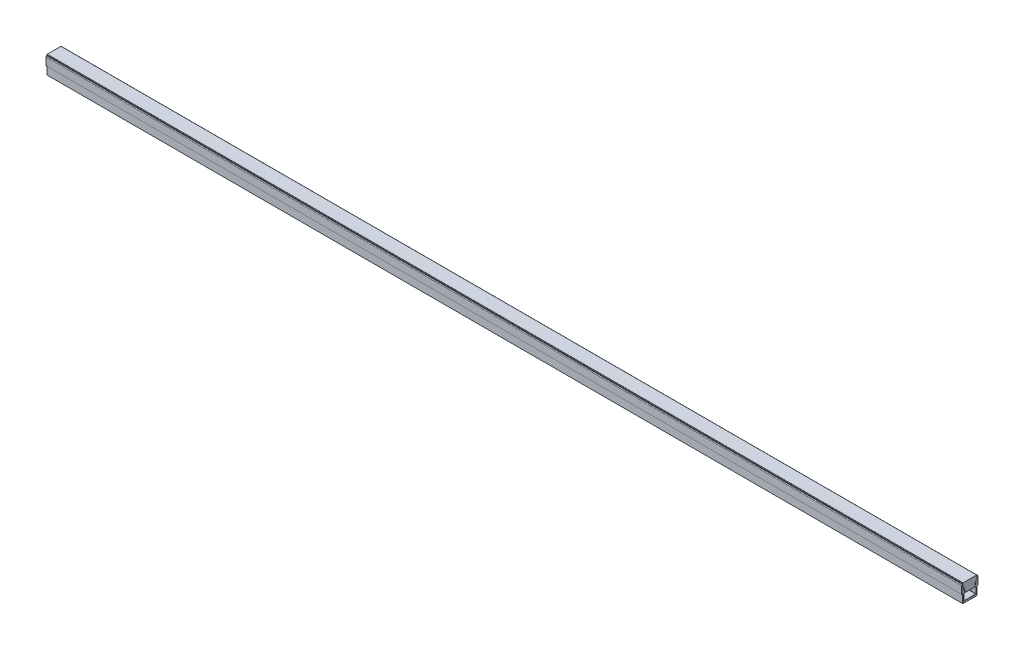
ISO-10303-21;
HEADER;
FILE_DESCRIPTION(('STEP AP214'),'2;1');
FILE_NAME('part.step','',(''),(''),'','','');
FILE_SCHEMA(('AUTOMOTIVE_DESIGN { 1 0 10303 214 1 1 1 1 }'));
ENDSEC;
DATA;
#1=APPLICATION_CONTEXT('core data for automotive mechanical design processes');
#2=APPLICATION_PROTOCOL_DEFINITION('international standard','automotive_design',2000,#1);
#3=PRODUCT_CONTEXT('',#1,'mechanical');
#4=PRODUCT('Part','Part','',(#3));
#5=PRODUCT_RELATED_PRODUCT_CATEGORY('part','',(#4));
#6=PRODUCT_DEFINITION_FORMATION('','',#4);
#7=PRODUCT_DEFINITION_CONTEXT('part definition',#1,'design');
#8=PRODUCT_DEFINITION('design','',#6,#7);
#9=PRODUCT_DEFINITION_SHAPE('','',#8);
#10=(LENGTH_UNIT() NAMED_UNIT(*) SI_UNIT(.MILLI.,.METRE.));
#11=(NAMED_UNIT(*) PLANE_ANGLE_UNIT() SI_UNIT($,.RADIAN.));
#12=(NAMED_UNIT(*) SI_UNIT($,.STERADIAN.) SOLID_ANGLE_UNIT());
#13=UNCERTAINTY_MEASURE_WITH_UNIT(LENGTH_MEASURE(1.E-05),#10,'distance_accuracy_value','');
#14=(GEOMETRIC_REPRESENTATION_CONTEXT(3) GLOBAL_UNCERTAINTY_ASSIGNED_CONTEXT((#13)) GLOBAL_UNIT_ASSIGNED_CONTEXT((#10,
#11,#12)) REPRESENTATION_CONTEXT('',''));
#15=CARTESIAN_POINT('',(0.,0.,0.));
#16=DIRECTION('',(0.,0.,1.));
#17=DIRECTION('',(1.,0.,0.));
#18=AXIS2_PLACEMENT_3D('',#15,#16,#17);
#19=CARTESIAN_POINT('',(254.,10.,0.));
#20=DIRECTION('',(1.,0.,0.));
#21=DIRECTION('',(0.,0.,-1.));
#22=AXIS2_PLACEMENT_3D('',#19,#20,#21);
#23=PLANE('',#22);
#24=DIRECTION('',(0.,1.,0.));
#25=VECTOR('',#24,1.);
#26=CARTESIAN_POINT('',(254.,4.80000000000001,-2.76));
#27=LINE('',#26,#25);
#28=CARTESIAN_POINT('',(254.,4.80000000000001,-2.76));
#29=VERTEX_POINT('',#28);
#30=CARTESIAN_POINT('',(254.,6.00000000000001,-2.76));
#31=VERTEX_POINT('',#30);
#32=EDGE_CURVE('P0_E94',#29,#31,#27,.T.);
#33=ORIENTED_EDGE('',*,*,#32,.T.);
#34=CARTESIAN_POINT('',(254.,15.2039290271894,18.3850517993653));
#35=DIRECTION('',(1.,0.,0.));
#36=DIRECTION('',(0.,0.,1.));
#37=AXIS2_PLACEMENT_3D('',#34,#35,#36);
#38=CIRCLE('',#37,23.0613426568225);
#39=CARTESIAN_POINT('',(254.,9.50000000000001,-3.95976233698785));
#40=VERTEX_POINT('',#39);
#41=EDGE_CURVE('P0_E105',#31,#40,#38,.T.);
#42=ORIENTED_EDGE('',*,*,#41,.T.);
#43=DIRECTION('',(0.,-1.,0.));
#44=VECTOR('',#43,1.);
#45=CARTESIAN_POINT('',(254.,10.,-3.95976233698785));
#46=LINE('',#45,#44);
#47=CARTESIAN_POINT('',(254.,9.80000000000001,-3.95976233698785));
#48=VERTEX_POINT('',#47);
#49=EDGE_CURVE('P0_E128',#48,#40,#46,.T.);
#50=ORIENTED_EDGE('',*,*,#49,.F.);
#51=CARTESIAN_POINT('',(254.,9.80000000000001,-3.75976233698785));
#52=DIRECTION('',(1.,0.,0.));
#53=DIRECTION('',(0.,0.,-1.));
#54=AXIS2_PLACEMENT_3D('',#51,#52,#53);
#55=CIRCLE('',#54,0.2);
#56=CARTESIAN_POINT('',(254.,10.,-3.75976233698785));
#57=VERTEX_POINT('',#56);
#58=EDGE_CURVE('P0_E153',#48,#57,#55,.T.);
#59=ORIENTED_EDGE('',*,*,#58,.T.);
#60=DIRECTION('',(0.,0.,1.));
#61=VECTOR('',#60,1.);
#62=CARTESIAN_POINT('',(254.,10.,0.));
#63=LINE('',#62,#61);
#64=CARTESIAN_POINT('',(254.,10.,3.75976233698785));
#65=VERTEX_POINT('',#64);
#66=EDGE_CURVE('P0_E132',#57,#65,#63,.T.);
#67=ORIENTED_EDGE('',*,*,#66,.T.);
#68=CARTESIAN_POINT('',(254.,9.80000000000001,3.75976233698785));
#69=DIRECTION('',(1.,0.,0.));
#70=DIRECTION('',(0.,0.,-1.));
#71=AXIS2_PLACEMENT_3D('',#68,#69,#70);
#72=CIRCLE('',#71,0.2);
#73=CARTESIAN_POINT('',(254.,9.80000000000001,3.95976233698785));
#74=VERTEX_POINT('',#73);
#75=EDGE_CURVE('P0_E24',#65,#74,#72,.T.);
#76=ORIENTED_EDGE('',*,*,#75,.T.);
#77=DIRECTION('',(0.,-1.,0.));
#78=VECTOR('',#77,1.);
#79=CARTESIAN_POINT('',(254.,10.,3.95976233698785));
#80=LINE('',#79,#78);
#81=CARTESIAN_POINT('',(254.,9.50000000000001,3.95976233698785));
#82=VERTEX_POINT('',#81);
#83=EDGE_CURVE('P0_E116',#74,#82,#80,.T.);
#84=ORIENTED_EDGE('',*,*,#83,.T.);
#85=CARTESIAN_POINT('',(254.,15.2039290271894,-18.3850517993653));
#86=DIRECTION('',(-1.,0.,0.));
#87=DIRECTION('',(0.,0.,-1.));
#88=AXIS2_PLACEMENT_3D('',#85,#86,#87);
#89=CIRCLE('',#88,23.0613426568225);
#90=CARTESIAN_POINT('',(254.,6.00000000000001,2.76));
#91=VERTEX_POINT('',#90);
#92=EDGE_CURVE('P0_E182',#91,#82,#89,.T.);
#93=ORIENTED_EDGE('',*,*,#92,.F.);
#94=DIRECTION('',(0.,1.,0.));
#95=VECTOR('',#94,1.);
#96=CARTESIAN_POINT('',(254.,4.80000000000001,2.76));
#97=LINE('',#96,#95);
#98=CARTESIAN_POINT('',(254.,4.80000000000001,2.76));
#99=VERTEX_POINT('',#98);
#100=EDGE_CURVE('P0_E112',#99,#91,#97,.T.);
#101=ORIENTED_EDGE('',*,*,#100,.F.);
#102=DIRECTION('',(0.,0.,-1.));
#103=VECTOR('',#102,1.);
#104=CARTESIAN_POINT('',(254.,4.80000000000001,2.76));
#105=LINE('',#104,#103);
#106=EDGE_CURVE('P0_E109',#99,#29,#105,.T.);
#107=ORIENTED_EDGE('',*,*,#106,.T.);
#108=EDGE_LOOP('',(#33,#42,#50,#59,#67,#76,#84,#93,#101,#107));
#109=FACE_BOUND('',#108,.T.);
#110=ADVANCED_FACE('P0_F16',(#109),#23,.T.);
#111=CARTESIAN_POINT('',(-254.,10.,0.));
#112=DIRECTION('',(1.,0.,0.));
#113=DIRECTION('',(0.,0.,-1.));
#114=AXIS2_PLACEMENT_3D('',#111,#112,#113);
#115=PLANE('',#114);
#116=CARTESIAN_POINT('',(-254.,15.2039290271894,18.3850517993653));
#117=DIRECTION('',(1.,0.,0.));
#118=DIRECTION('',(0.,0.,-1.));
#119=AXIS2_PLACEMENT_3D('',#116,#117,#118);
#120=CIRCLE('',#119,23.0613426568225);
#121=CARTESIAN_POINT('',(-254.,9.50000000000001,-3.95976233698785));
#122=VERTEX_POINT('',#121);
#123=CARTESIAN_POINT('',(-254.,6.00000000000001,-2.76));
#124=VERTEX_POINT('',#123);
#125=EDGE_CURVE('P0_E188',#122,#124,#120,.F.);
#126=ORIENTED_EDGE('',*,*,#125,.T.);
#127=DIRECTION('',(0.,-1.,0.));
#128=VECTOR('',#127,1.);
#129=CARTESIAN_POINT('',(-254.,4.80000000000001,-2.76));
#130=LINE('',#129,#128);
#131=CARTESIAN_POINT('',(-254.,4.80000000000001,-2.76));
#132=VERTEX_POINT('',#131);
#133=EDGE_CURVE('P0_E185',#124,#132,#130,.T.);
#134=ORIENTED_EDGE('',*,*,#133,.T.);
#135=DIRECTION('',(0.,0.,-1.));
#136=VECTOR('',#135,1.);
#137=CARTESIAN_POINT('',(-254.,4.80000000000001,2.76));
#138=LINE('',#137,#136);
#139=CARTESIAN_POINT('',(-254.,4.80000000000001,2.76));
#140=VERTEX_POINT('',#139);
#141=EDGE_CURVE('P0_E121',#140,#132,#138,.T.);
#142=ORIENTED_EDGE('',*,*,#141,.F.);
#143=DIRECTION('',(0.,-1.,0.));
#144=VECTOR('',#143,1.);
#145=CARTESIAN_POINT('',(-254.,4.80000000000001,2.76));
#146=LINE('',#145,#144);
#147=CARTESIAN_POINT('',(-254.,6.00000000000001,2.76));
#148=VERTEX_POINT('',#147);
#149=EDGE_CURVE('P0_E177',#148,#140,#146,.T.);
#150=ORIENTED_EDGE('',*,*,#149,.F.);
#151=CARTESIAN_POINT('',(-254.,15.2039290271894,-18.3850517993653));
#152=DIRECTION('',(1.,0.,0.));
#153=DIRECTION('',(0.,0.,-1.));
#154=AXIS2_PLACEMENT_3D('',#151,#152,#153);
#155=CIRCLE('',#154,23.0613426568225);
#156=CARTESIAN_POINT('',(-254.,9.50000000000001,3.95976233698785));
#157=VERTEX_POINT('',#156);
#158=EDGE_CURVE('P0_E175',#157,#148,#155,.T.);
#159=ORIENTED_EDGE('',*,*,#158,.F.);
#160=DIRECTION('',(0.,-1.,0.));
#161=VECTOR('',#160,1.);
#162=CARTESIAN_POINT('',(-254.,10.,3.95976233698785));
#163=LINE('',#162,#161);
#164=CARTESIAN_POINT('',(-254.,9.80000000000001,3.95976233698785));
#165=VERTEX_POINT('',#164);
#166=EDGE_CURVE('P0_E125',#165,#157,#163,.T.);
#167=ORIENTED_EDGE('',*,*,#166,.F.);
#168=CARTESIAN_POINT('',(-254.,9.80000000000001,3.75976233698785));
#169=DIRECTION('',(1.,0.,0.));
#170=DIRECTION('',(0.,0.,-1.));
#171=AXIS2_PLACEMENT_3D('',#168,#169,#170);
#172=CIRCLE('',#171,0.2);
#173=CARTESIAN_POINT('',(-254.,10.,3.75976233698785));
#174=VERTEX_POINT('',#173);
#175=EDGE_CURVE('P0_E147',#165,#174,#172,.F.);
#176=ORIENTED_EDGE('',*,*,#175,.T.);
#177=DIRECTION('',(0.,0.,1.));
#178=VECTOR('',#177,1.);
#179=CARTESIAN_POINT('',(-254.,10.,0.));
#180=LINE('',#179,#178);
#181=CARTESIAN_POINT('',(-254.,10.,-3.75976233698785));
#182=VERTEX_POINT('',#181);
#183=EDGE_CURVE('P0_E122',#182,#174,#180,.T.);
#184=ORIENTED_EDGE('',*,*,#183,.F.);
#185=CARTESIAN_POINT('',(-254.,9.80000000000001,-3.75976233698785));
#186=DIRECTION('',(1.,0.,0.));
#187=DIRECTION('',(0.,0.,-1.));
#188=AXIS2_PLACEMENT_3D('',#185,#186,#187);
#189=CIRCLE('',#188,0.2);
#190=CARTESIAN_POINT('',(-254.,9.80000000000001,-3.95976233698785));
#191=VERTEX_POINT('',#190);
#192=EDGE_CURVE('P0_E145',#182,#191,#189,.F.);
#193=ORIENTED_EDGE('',*,*,#192,.T.);
#194=DIRECTION('',(0.,-1.,0.));
#195=VECTOR('',#194,1.);
#196=CARTESIAN_POINT('',(-254.,10.,-3.95976233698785));
#197=LINE('',#196,#195);
#198=EDGE_CURVE('P0_E173',#191,#122,#197,.T.);
#199=ORIENTED_EDGE('',*,*,#198,.T.);
#200=EDGE_LOOP('',(#126,#134,#142,#150,#159,#167,#176,#184,#193,#199));
#201=FACE_BOUND('',#200,.T.);
#202=ADVANCED_FACE('P0_F166',(#201),#115,.F.);
#203=CARTESIAN_POINT('',(254.,10.,0.));
#204=DIRECTION('',(0.,-1.,0.));
#205=DIRECTION('',(0.,0.,-1.));
#206=AXIS2_PLACEMENT_3D('',#203,#204,#205);
#207=PLANE('',#206);
#208=ORIENTED_EDGE('',*,*,#183,.T.);
#209=DIRECTION('',(-1.,0.,0.));
#210=VECTOR('',#209,1.);
#211=CARTESIAN_POINT('',(254.,10.,3.75976233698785));
#212=LINE('',#211,#210);
#213=EDGE_CURVE('P0_E37',#174,#65,#212,.F.);
#214=ORIENTED_EDGE('',*,*,#213,.T.);
#215=ORIENTED_EDGE('',*,*,#66,.F.);
#216=DIRECTION('',(-1.,0.,0.));
#217=VECTOR('',#216,1.);
#218=CARTESIAN_POINT('',(-254.,10.,-3.75976233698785));
#219=LINE('',#218,#217);
#220=EDGE_CURVE('P0_E149',#57,#182,#219,.T.);
#221=ORIENTED_EDGE('',*,*,#220,.T.);
#222=EDGE_LOOP('',(#208,#214,#215,#221));
#223=FACE_BOUND('',#222,.T.);
#224=ADVANCED_FACE('P0_F168',(#223),#207,.F.);
#225=CARTESIAN_POINT('',(254.,10.,3.95976233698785));
#226=DIRECTION('',(0.,0.,-1.));
#227=DIRECTION('',(-1.,0.,0.));
#228=AXIS2_PLACEMENT_3D('',#225,#226,#227);
#229=PLANE('',#228);
#230=ORIENTED_EDGE('',*,*,#83,.F.);
#231=DIRECTION('',(-1.,0.,0.));
#232=VECTOR('',#231,1.);
#233=CARTESIAN_POINT('',(254.,9.80000000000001,3.95976233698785));
#234=LINE('',#233,#232);
#235=EDGE_CURVE('P0_E142',#74,#165,#234,.T.);
#236=ORIENTED_EDGE('',*,*,#235,.T.);
#237=ORIENTED_EDGE('',*,*,#166,.T.);
#238=DIRECTION('',(-1.,0.,0.));
#239=VECTOR('',#238,1.);
#240=CARTESIAN_POINT('',(254.,9.50000000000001,3.95976233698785));
#241=LINE('',#240,#239);
#242=EDGE_CURVE('P0_E140',#82,#157,#241,.T.);
#243=ORIENTED_EDGE('',*,*,#242,.F.);
#244=EDGE_LOOP('',(#230,#236,#237,#243));
#245=FACE_BOUND('',#244,.T.);
#246=ADVANCED_FACE('P0_F160',(#245),#229,.F.);
#247=CARTESIAN_POINT('',(254.,4.80000000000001,2.76));
#248=DIRECTION('',(0.,1.,0.));
#249=DIRECTION('',(0.,0.,1.));
#250=AXIS2_PLACEMENT_3D('',#247,#248,#249);
#251=PLANE('',#250);
#252=ORIENTED_EDGE('',*,*,#141,.T.);
#253=DIRECTION('',(-1.,0.,0.));
#254=VECTOR('',#253,1.);
#255=CARTESIAN_POINT('',(254.,4.80000000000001,-2.76));
#256=LINE('',#255,#254);
#257=EDGE_CURVE('P0_E98',#29,#132,#256,.T.);
#258=ORIENTED_EDGE('',*,*,#257,.F.);
#259=ORIENTED_EDGE('',*,*,#106,.F.);
#260=DIRECTION('',(-1.,0.,0.));
#261=VECTOR('',#260,1.);
#262=CARTESIAN_POINT('',(254.,4.80000000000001,2.76));
#263=LINE('',#262,#261);
#264=EDGE_CURVE('P0_E115',#99,#140,#263,.T.);
#265=ORIENTED_EDGE('',*,*,#264,.T.);
#266=EDGE_LOOP('',(#252,#258,#259,#265));
#267=FACE_BOUND('',#266,.T.);
#268=ADVANCED_FACE('P0_F119',(#267),#251,.F.);
#269=CARTESIAN_POINT('',(254.,10.,-3.95976233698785));
#270=DIRECTION('',(0.,0.,-1.));
#271=DIRECTION('',(-1.,0.,0.));
#272=AXIS2_PLACEMENT_3D('',#269,#270,#271);
#273=PLANE('',#272);
#274=ORIENTED_EDGE('',*,*,#198,.F.);
#275=DIRECTION('',(-1.,0.,0.));
#276=VECTOR('',#275,1.);
#277=CARTESIAN_POINT('',(254.,9.80000000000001,-3.95976233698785));
#278=LINE('',#277,#276);
#279=EDGE_CURVE('P0_E11',#191,#48,#278,.F.);
#280=ORIENTED_EDGE('',*,*,#279,.T.);
#281=ORIENTED_EDGE('',*,*,#49,.T.);
#282=DIRECTION('',(-1.,0.,0.));
#283=VECTOR('',#282,1.);
#284=CARTESIAN_POINT('',(254.,9.50000000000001,-3.95976233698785));
#285=LINE('',#284,#283);
#286=EDGE_CURVE('P0_E123',#40,#122,#285,.T.);
#287=ORIENTED_EDGE('',*,*,#286,.T.);
#288=EDGE_LOOP('',(#274,#280,#281,#287));
#289=FACE_BOUND('',#288,.T.);
#290=ADVANCED_FACE('P0_F174',(#289),#273,.T.);
#291=CARTESIAN_POINT('',(254.,9.80000000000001,3.75976233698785));
#292=DIRECTION('',(-1.,0.,0.));
#293=DIRECTION('',(0.,0.,1.));
#294=AXIS2_PLACEMENT_3D('',#291,#292,#293);
#295=CYLINDRICAL_SURFACE('',#294,0.2);
#296=ORIENTED_EDGE('',*,*,#75,.F.);
#297=ORIENTED_EDGE('',*,*,#213,.F.);
#298=ORIENTED_EDGE('',*,*,#175,.F.);
#299=ORIENTED_EDGE('',*,*,#235,.F.);
#300=EDGE_LOOP('',(#296,#297,#298,#299));
#301=FACE_BOUND('',#300,.T.);
#302=ADVANCED_FACE('P0_F162',(#301),#295,.T.);
#303=CARTESIAN_POINT('',(254.,9.80000000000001,-3.75976233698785));
#304=DIRECTION('',(1.,0.,0.));
#305=DIRECTION('',(0.,0.,-1.));
#306=AXIS2_PLACEMENT_3D('',#303,#304,#305);
#307=CYLINDRICAL_SURFACE('',#306,0.2);
#308=ORIENTED_EDGE('',*,*,#58,.F.);
#309=ORIENTED_EDGE('',*,*,#279,.F.);
#310=ORIENTED_EDGE('',*,*,#192,.F.);
#311=ORIENTED_EDGE('',*,*,#220,.F.);
#312=EDGE_LOOP('',(#308,#309,#310,#311));
#313=FACE_BOUND('',#312,.T.);
#314=ADVANCED_FACE('P0_F18',(#313),#307,.T.);
#315=CARTESIAN_POINT('',(-258.850714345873,4.80000000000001,2.76));
#316=DIRECTION('',(0.,0.,-1.));
#317=DIRECTION('',(-1.,0.,0.));
#318=AXIS2_PLACEMENT_3D('',#315,#316,#317);
#319=PLANE('',#318);
#320=ORIENTED_EDGE('',*,*,#149,.T.);
#321=ORIENTED_EDGE('',*,*,#264,.F.);
#322=ORIENTED_EDGE('',*,*,#100,.T.);
#323=DIRECTION('',(1.,0.,0.));
#324=VECTOR('',#323,1.);
#325=CARTESIAN_POINT('',(-258.850714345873,6.00000000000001,2.76));
#326=LINE('',#325,#324);
#327=EDGE_CURVE('P0_E180',#148,#91,#326,.T.);
#328=ORIENTED_EDGE('',*,*,#327,.F.);
#329=EDGE_LOOP('',(#320,#321,#322,#328));
#330=FACE_BOUND('',#329,.T.);
#331=ADVANCED_FACE('P0_F202',(#330),#319,.F.);
#332=CARTESIAN_POINT('',(-258.850714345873,15.2039290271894,-18.3850517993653));
#333=DIRECTION('',(1.,0.,0.));
#334=DIRECTION('',(0.,0.,-1.));
#335=AXIS2_PLACEMENT_3D('',#332,#333,#334);
#336=CYLINDRICAL_SURFACE('',#335,23.0613426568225);
#337=ORIENTED_EDGE('',*,*,#158,.T.);
#338=ORIENTED_EDGE('',*,*,#327,.T.);
#339=ORIENTED_EDGE('',*,*,#92,.T.);
#340=ORIENTED_EDGE('',*,*,#242,.T.);
#341=EDGE_LOOP('',(#337,#338,#339,#340));
#342=FACE_BOUND('',#341,.T.);
#343=ADVANCED_FACE('P0_F194',(#342),#336,.T.);
#344=CARTESIAN_POINT('',(-258.850714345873,15.2039290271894,18.3850517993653));
#345=DIRECTION('',(1.,0.,0.));
#346=DIRECTION('',(0.,0.,-1.));
#347=AXIS2_PLACEMENT_3D('',#344,#345,#346);
#348=CYLINDRICAL_SURFACE('',#347,23.0613426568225);
#349=ORIENTED_EDGE('',*,*,#286,.F.);
#350=ORIENTED_EDGE('',*,*,#41,.F.);
#351=DIRECTION('',(1.,0.,0.));
#352=VECTOR('',#351,1.);
#353=CARTESIAN_POINT('',(-258.850714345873,6.00000000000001,-2.76));
#354=LINE('',#353,#352);
#355=EDGE_CURVE('P0_E101',#124,#31,#354,.T.);
#356=ORIENTED_EDGE('',*,*,#355,.F.);
#357=ORIENTED_EDGE('',*,*,#125,.F.);
#358=EDGE_LOOP('',(#349,#350,#356,#357));
#359=FACE_BOUND('',#358,.T.);
#360=ADVANCED_FACE('P0_F192',(#359),#348,.T.);
#361=CARTESIAN_POINT('',(-258.850714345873,4.80000000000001,-2.76));
#362=DIRECTION('',(0.,0.,-1.));
#363=DIRECTION('',(-1.,0.,0.));
#364=AXIS2_PLACEMENT_3D('',#361,#362,#363);
#365=PLANE('',#364);
#366=ORIENTED_EDGE('',*,*,#355,.T.);
#367=ORIENTED_EDGE('',*,*,#32,.F.);
#368=ORIENTED_EDGE('',*,*,#257,.T.);
#369=ORIENTED_EDGE('',*,*,#133,.F.);
#370=EDGE_LOOP('',(#366,#367,#368,#369));
#371=FACE_BOUND('',#370,.T.);
#372=ADVANCED_FACE('P0_F96',(#371),#365,.T.);
#373=CLOSED_SHELL('',(#110,#202,#224,#246,#268,#290,#302,#314,#331,#343,#360,#372));
#374=MANIFOLD_SOLID_BREP('P0_B1',#373);
#375=CARTESIAN_POINT('',(-254.,0.,0.));
#376=DIRECTION('',(-1.,0.,0.));
#377=DIRECTION('',(0.,0.,1.));
#378=AXIS2_PLACEMENT_3D('',#375,#376,#377);
#379=PLANE('',#378);
#380=CARTESIAN_POINT('',(-254.,9.1,-4.26070409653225));
#381=DIRECTION('',(-1.,0.,0.));
#382=DIRECTION('',(0.,0.,1.));
#383=AXIS2_PLACEMENT_3D('',#380,#381,#382);
#384=CIRCLE('',#383,0.4);
#385=CARTESIAN_POINT('',(-254.,9.37421424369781,-3.96948845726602));
#386=VERTEX_POINT('',#385);
#387=CARTESIAN_POINT('',(-254.,9.49615167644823,-4.20535204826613));
#388=VERTEX_POINT('',#387);
#389=EDGE_CURVE('P1_E813',#386,#388,#384,.T.);
#390=ORIENTED_EDGE('',*,*,#389,.T.);
#391=CARTESIAN_POINT('',(-254.,9.1,-4.15));
#392=DIRECTION('',(-1.,0.,0.));
#393=DIRECTION('',(0.,0.,1.));
#394=AXIS2_PLACEMENT_3D('',#391,#392,#393);
#395=CIRCLE('',#394,0.4);
#396=CARTESIAN_POINT('',(-254.,9.2936491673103,-4.50000000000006));
#397=VERTEX_POINT('',#396);
#398=EDGE_CURVE('P1_E815',#388,#397,#395,.T.);
#399=ORIENTED_EDGE('',*,*,#398,.T.);
#400=DIRECTION('',(0.,-1.,0.));
#401=VECTOR('',#400,1.);
#402=CARTESIAN_POINT('',(-254.,0.,-4.50000000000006));
#403=LINE('',#402,#401);
#404=CARTESIAN_POINT('',(-254.,4.84999999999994,-4.50000000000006));
#405=VERTEX_POINT('',#404);
#406=EDGE_CURVE('P1_E486',#397,#405,#403,.T.);
#407=ORIENTED_EDGE('',*,*,#406,.T.);
#408=DIRECTION('',(0.,0.,1.));
#409=VECTOR('',#408,1.);
#410=CARTESIAN_POINT('',(-254.,4.84999999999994,0.));
#411=LINE('',#410,#409);
#412=CARTESIAN_POINT('',(-254.,4.84999999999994,-3.99999999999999));
#413=VERTEX_POINT('',#412);
#414=EDGE_CURVE('P1_E484',#405,#413,#411,.T.);
#415=ORIENTED_EDGE('',*,*,#414,.T.);
#416=DIRECTION('',(0.,0.707106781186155,-0.70710678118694));
#417=VECTOR('',#416,1.);
#418=CARTESIAN_POINT('',(-254.,0.425000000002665,0.425000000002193));
#419=LINE('',#418,#417);
#420=CARTESIAN_POINT('',(-254.,4.8,-3.95));
#421=VERTEX_POINT('',#420);
#422=EDGE_CURVE('P1_E481',#421,#413,#419,.T.);
#423=ORIENTED_EDGE('',*,*,#422,.F.);
#424=DIRECTION('',(0.,0.707106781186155,-0.70710678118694));
#425=VECTOR('',#424,1.);
#426=CARTESIAN_POINT('',(-254.,0.425000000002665,0.425000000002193));
#427=LINE('',#426,#425);
#428=CARTESIAN_POINT('',(-254.,4.75000000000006,-3.90000000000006));
#429=VERTEX_POINT('',#428);
#430=EDGE_CURVE('P1_E478',#429,#421,#427,.T.);
#431=ORIENTED_EDGE('',*,*,#430,.F.);
#432=DIRECTION('',(0.,-1.,0.));
#433=VECTOR('',#432,1.);
#434=CARTESIAN_POINT('',(-254.,0.,-3.90000000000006));
#435=LINE('',#434,#433);
#436=CARTESIAN_POINT('',(-254.,0.0499999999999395,-3.90000000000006));
#437=VERTEX_POINT('',#436);
#438=EDGE_CURVE('P1_E476',#429,#437,#435,.T.);
#439=ORIENTED_EDGE('',*,*,#438,.T.);
#440=DIRECTION('',(0.,0.,1.));
#441=VECTOR('',#440,1.);
#442=CARTESIAN_POINT('',(-254.,0.0499999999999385,3.95));
#443=LINE('',#442,#441);
#444=CARTESIAN_POINT('',(-254.,0.0499999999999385,3.90000000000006));
#445=VERTEX_POINT('',#444);
#446=EDGE_CURVE('P1_E474',#437,#445,#443,.T.);
#447=ORIENTED_EDGE('',*,*,#446,.T.);
#448=DIRECTION('',(0.,1.,0.));
#449=VECTOR('',#448,1.);
#450=CARTESIAN_POINT('',(-254.,4.8,3.90000000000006));
#451=LINE('',#450,#449);
#452=CARTESIAN_POINT('',(-254.,4.75000000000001,3.90000000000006));
#453=VERTEX_POINT('',#452);
#454=EDGE_CURVE('P1_E472',#445,#453,#451,.T.);
#455=ORIENTED_EDGE('',*,*,#454,.T.);
#456=DIRECTION('',(0.,-0.70710678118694,-0.707106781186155));
#457=VECTOR('',#456,1.);
#458=CARTESIAN_POINT('',(-254.,0.424999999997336,-0.424999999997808));
#459=LINE('',#458,#457);
#460=CARTESIAN_POINT('',(-254.,4.8,3.95));
#461=VERTEX_POINT('',#460);
#462=EDGE_CURVE('P1_E469',#461,#453,#459,.T.);
#463=ORIENTED_EDGE('',*,*,#462,.F.);
#464=DIRECTION('',(0.,-0.70710678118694,-0.707106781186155));
#465=VECTOR('',#464,1.);
#466=CARTESIAN_POINT('',(-254.,0.424999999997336,-0.424999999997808));
#467=LINE('',#466,#465);
#468=CARTESIAN_POINT('',(-254.,4.85,3.99999999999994));
#469=VERTEX_POINT('',#468);
#470=EDGE_CURVE('P1_E466',#469,#461,#467,.T.);
#471=ORIENTED_EDGE('',*,*,#470,.F.);
#472=DIRECTION('',(0.,0.,1.));
#473=VECTOR('',#472,1.);
#474=CARTESIAN_POINT('',(-254.,4.85,4.55));
#475=LINE('',#474,#473);
#476=CARTESIAN_POINT('',(-254.,4.85,4.50000000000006));
#477=VERTEX_POINT('',#476);
#478=EDGE_CURVE('P1_E464',#469,#477,#475,.T.);
#479=ORIENTED_EDGE('',*,*,#478,.T.);
#480=DIRECTION('',(0.,1.,0.));
#481=VECTOR('',#480,1.);
#482=CARTESIAN_POINT('',(-254.,9.5,4.50000000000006));
#483=LINE('',#482,#481);
#484=CARTESIAN_POINT('',(-254.,9.29364916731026,4.50000000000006));
#485=VERTEX_POINT('',#484);
#486=EDGE_CURVE('P1_E461',#477,#485,#483,.T.);
#487=ORIENTED_EDGE('',*,*,#486,.T.);
#488=CARTESIAN_POINT('',(-254.,9.1,4.15));
#489=DIRECTION('',(-1.,0.,0.));
#490=DIRECTION('',(0.,0.,1.));
#491=AXIS2_PLACEMENT_3D('',#488,#489,#490);
#492=CIRCLE('',#491,0.4);
#493=CARTESIAN_POINT('',(-254.,9.49615167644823,4.20535204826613));
#494=VERTEX_POINT('',#493);
#495=EDGE_CURVE('P1_E811',#485,#494,#492,.T.);
#496=ORIENTED_EDGE('',*,*,#495,.T.);
#497=CARTESIAN_POINT('',(-254.,9.1,4.26070409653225));
#498=DIRECTION('',(-1.,0.,0.));
#499=DIRECTION('',(0.,0.,1.));
#500=AXIS2_PLACEMENT_3D('',#497,#498,#499);
#501=CIRCLE('',#500,0.4);
#502=CARTESIAN_POINT('',(-254.,9.37421424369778,3.96948845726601));
#503=VERTEX_POINT('',#502);
#504=EDGE_CURVE('P1_E604',#494,#503,#501,.T.);
#505=ORIENTED_EDGE('',*,*,#504,.T.);
#506=DIRECTION('',(0.,-0.968917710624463,-0.24738324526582));
#507=VECTOR('',#506,1.);
#508=CARTESIAN_POINT('',(-254.,4.7876308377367,2.79844588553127));
#509=LINE('',#508,#507);
#510=CARTESIAN_POINT('',(-254.,4.85000000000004,2.81436992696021));
#511=VERTEX_POINT('',#510);
#512=EDGE_CURVE('P1_E488',#503,#511,#509,.T.);
#513=ORIENTED_EDGE('',*,*,#512,.T.);
#514=DIRECTION('',(0.,0.,1.));
#515=VECTOR('',#514,1.);
#516=CARTESIAN_POINT('',(-254.,4.85000000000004,3.35));
#517=LINE('',#516,#515);
#518=CARTESIAN_POINT('',(-254.,4.85000000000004,3.29999999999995));
#519=VERTEX_POINT('',#518);
#520=EDGE_CURVE('P1_E490',#511,#519,#517,.T.);
#521=ORIENTED_EDGE('',*,*,#520,.T.);
#522=DIRECTION('',(0.,0.707106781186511,-0.707106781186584));
#523=VECTOR('',#522,1.);
#524=CARTESIAN_POINT('',(-254.,4.07500000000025,4.07499999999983));
#525=LINE('',#524,#523);
#526=CARTESIAN_POINT('',(-254.,4.8,3.35));
#527=VERTEX_POINT('',#526);
#528=EDGE_CURVE('P1_E492',#527,#519,#525,.T.);
#529=ORIENTED_EDGE('',*,*,#528,.F.);
#530=DIRECTION('',(0.,0.707106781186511,-0.707106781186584));
#531=VECTOR('',#530,1.);
#532=CARTESIAN_POINT('',(-254.,4.07500000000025,4.07499999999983));
#533=LINE('',#532,#531);
#534=CARTESIAN_POINT('',(-254.,4.74999999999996,3.40000000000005));
#535=VERTEX_POINT('',#534);
#536=EDGE_CURVE('P1_E495',#535,#527,#533,.T.);
#537=ORIENTED_EDGE('',*,*,#536,.F.);
#538=DIRECTION('',(0.,-1.,0.));
#539=VECTOR('',#538,1.);
#540=CARTESIAN_POINT('',(-254.,1.1,3.40000000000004));
#541=LINE('',#540,#539);
#542=CARTESIAN_POINT('',(-254.,1.15000000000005,3.40000000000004));
#543=VERTEX_POINT('',#542);
#544=EDGE_CURVE('P1_E498',#535,#543,#541,.T.);
#545=ORIENTED_EDGE('',*,*,#544,.T.);
#546=DIRECTION('',(0.,0.707106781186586,0.707106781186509));
#547=VECTOR('',#546,1.);
#548=CARTESIAN_POINT('',(-254.,-1.12500000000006,1.12500000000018));
#549=LINE('',#548,#547);
#550=CARTESIAN_POINT('',(-254.,1.1,3.35));
#551=VERTEX_POINT('',#550);
#552=EDGE_CURVE('P1_E500',#551,#543,#549,.T.);
#553=ORIENTED_EDGE('',*,*,#552,.F.);
#554=DIRECTION('',(0.,0.707106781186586,0.707106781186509));
#555=VECTOR('',#554,1.);
#556=CARTESIAN_POINT('',(-254.,-1.12500000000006,1.12500000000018));
#557=LINE('',#556,#555);
#558=CARTESIAN_POINT('',(-254.,1.04999999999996,3.29999999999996));
#559=VERTEX_POINT('',#558);
#560=EDGE_CURVE('P1_E503',#559,#551,#557,.T.);
#561=ORIENTED_EDGE('',*,*,#560,.F.);
#562=DIRECTION('',(0.,0.,-1.));
#563=VECTOR('',#562,1.);
#564=CARTESIAN_POINT('',(-254.,1.04999999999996,-3.35));
#565=LINE('',#564,#563);
#566=CARTESIAN_POINT('',(-254.,1.04999999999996,-3.29999999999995));
#567=VERTEX_POINT('',#566);
#568=EDGE_CURVE('P1_E506',#559,#567,#565,.T.);
#569=ORIENTED_EDGE('',*,*,#568,.T.);
#570=DIRECTION('',(0.,-0.707106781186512,0.707106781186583));
#571=VECTOR('',#570,1.);
#572=CARTESIAN_POINT('',(-254.,-1.12499999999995,-1.12499999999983));
#573=LINE('',#572,#571);
#574=CARTESIAN_POINT('',(-254.,1.1,-3.35));
#575=VERTEX_POINT('',#574);
#576=EDGE_CURVE('P1_E508',#575,#567,#573,.T.);
#577=ORIENTED_EDGE('',*,*,#576,.F.);
#578=DIRECTION('',(0.,-0.707106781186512,0.707106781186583));
#579=VECTOR('',#578,1.);
#580=CARTESIAN_POINT('',(-254.,-1.12499999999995,-1.12499999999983));
#581=LINE('',#580,#579);
#582=CARTESIAN_POINT('',(-254.,1.15000000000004,-3.40000000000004));
#583=VERTEX_POINT('',#582);
#584=EDGE_CURVE('P1_E511',#583,#575,#581,.T.);
#585=ORIENTED_EDGE('',*,*,#584,.F.);
#586=DIRECTION('',(0.,1.,0.));
#587=VECTOR('',#586,1.);
#588=CARTESIAN_POINT('',(-254.,0.,-3.40000000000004));
#589=LINE('',#588,#587);
#590=CARTESIAN_POINT('',(-254.,4.74999999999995,-3.40000000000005));
#591=VERTEX_POINT('',#590);
#592=EDGE_CURVE('P1_E514',#583,#591,#589,.T.);
#593=ORIENTED_EDGE('',*,*,#592,.T.);
#594=DIRECTION('',(0.,-0.707106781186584,-0.707106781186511));
#595=VECTOR('',#594,1.);
#596=CARTESIAN_POINT('',(-254.,4.07499999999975,-4.07500000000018));
#597=LINE('',#596,#595);
#598=CARTESIAN_POINT('',(-254.,4.8,-3.35));
#599=VERTEX_POINT('',#598);
#600=EDGE_CURVE('P1_E516',#599,#591,#597,.T.);
#601=ORIENTED_EDGE('',*,*,#600,.F.);
#602=DIRECTION('',(0.,-0.707106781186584,-0.707106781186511));
#603=VECTOR('',#602,1.);
#604=CARTESIAN_POINT('',(-254.,4.07499999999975,-4.07500000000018));
#605=LINE('',#604,#603);
#606=CARTESIAN_POINT('',(-254.,4.85000000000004,-3.29999999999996));
#607=VERTEX_POINT('',#606);
#608=EDGE_CURVE('P1_E519',#607,#599,#605,.T.);
#609=ORIENTED_EDGE('',*,*,#608,.F.);
#610=DIRECTION('',(0.,0.,1.));
#611=VECTOR('',#610,1.);
#612=CARTESIAN_POINT('',(-254.,4.85000000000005,0.));
#613=LINE('',#612,#611);
#614=CARTESIAN_POINT('',(-254.,4.85000000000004,-2.81436992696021));
#615=VERTEX_POINT('',#614);
#616=EDGE_CURVE('P1_E522',#607,#615,#613,.T.);
#617=ORIENTED_EDGE('',*,*,#616,.T.);
#618=DIRECTION('',(0.,0.968917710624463,-0.24738324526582));
#619=VECTOR('',#618,1.);
#620=CARTESIAN_POINT('',(-254.,-0.377775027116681,-1.479618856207));
#621=LINE('',#620,#619);
#622=EDGE_CURVE('P1_E524',#615,#386,#621,.T.);
#623=ORIENTED_EDGE('',*,*,#622,.T.);
#624=EDGE_LOOP('',(#390,#399,#407,#415,#423,#431,#439,#447,#455,#463,#471,#479,#487,#496,#505,
#513,#521,#529,#537,#545,#553,#561,#569,#577,#585,#593,#601,#609,#617,#623));
#625=FACE_BOUND('',#624,.T.);
#626=ADVANCED_FACE('P1_F15',(#625),#379,.T.);
#627=CARTESIAN_POINT('',(254.,0.,0.));
#628=DIRECTION('',(-1.,0.,0.));
#629=DIRECTION('',(0.,0.,1.));
#630=AXIS2_PLACEMENT_3D('',#627,#628,#629);
#631=PLANE('',#630);
#632=DIRECTION('',(0.,1.,0.));
#633=VECTOR('',#632,1.);
#634=CARTESIAN_POINT('',(254.,9.5,-4.50000000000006));
#635=LINE('',#634,#633);
#636=CARTESIAN_POINT('',(254.,4.84999999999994,-4.50000000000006));
#637=VERTEX_POINT('',#636);
#638=CARTESIAN_POINT('',(254.,9.29364916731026,-4.50000000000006));
#639=VERTEX_POINT('',#638);
#640=EDGE_CURVE('P1_E399',#637,#639,#635,.T.);
#641=ORIENTED_EDGE('',*,*,#640,.T.);
#642=CARTESIAN_POINT('',(254.,9.1,-4.15));
#643=DIRECTION('',(-1.,0.,0.));
#644=DIRECTION('',(0.,0.,1.));
#645=AXIS2_PLACEMENT_3D('',#642,#643,#644);
#646=CIRCLE('',#645,0.4);
#647=CARTESIAN_POINT('',(254.,9.49615167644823,-4.20535204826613));
#648=VERTEX_POINT('',#647);
#649=EDGE_CURVE('P1_E830',#639,#648,#646,.F.);
#650=ORIENTED_EDGE('',*,*,#649,.T.);
#651=CARTESIAN_POINT('',(254.,9.1,-4.26070409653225));
#652=DIRECTION('',(-1.,0.,0.));
#653=DIRECTION('',(0.,0.,1.));
#654=AXIS2_PLACEMENT_3D('',#651,#652,#653);
#655=CIRCLE('',#654,0.4);
#656=CARTESIAN_POINT('',(254.,9.37421424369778,-3.96948845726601));
#657=VERTEX_POINT('',#656);
#658=EDGE_CURVE('P1_E828',#648,#657,#655,.F.);
#659=ORIENTED_EDGE('',*,*,#658,.T.);
#660=DIRECTION('',(0.,-0.968917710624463,0.24738324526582));
#661=VECTOR('',#660,1.);
#662=CARTESIAN_POINT('',(254.,4.7876308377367,-2.79844588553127));
#663=LINE('',#662,#661);
#664=CARTESIAN_POINT('',(254.,4.85000000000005,-2.81436992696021));
#665=VERTEX_POINT('',#664);
#666=EDGE_CURVE('P1_E430',#657,#665,#663,.T.);
#667=ORIENTED_EDGE('',*,*,#666,.T.);
#668=DIRECTION('',(0.,0.,-1.));
#669=VECTOR('',#668,1.);
#670=CARTESIAN_POINT('',(254.,4.85000000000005,-3.35));
#671=LINE('',#670,#669);
#672=CARTESIAN_POINT('',(254.,4.85000000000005,-3.29999999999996));
#673=VERTEX_POINT('',#672);
#674=EDGE_CURVE('P1_E426',#665,#673,#671,.T.);
#675=ORIENTED_EDGE('',*,*,#674,.T.);
#676=DIRECTION('',(0.,0.707106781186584,0.707106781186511));
#677=VECTOR('',#676,1.);
#678=CARTESIAN_POINT('',(254.,4.85000000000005,-3.29999999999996));
#679=LINE('',#678,#677);
#680=CARTESIAN_POINT('',(254.,4.8,-3.35));
#681=VERTEX_POINT('',#680);
#682=EDGE_CURVE('P1_E423',#681,#673,#679,.T.);
#683=ORIENTED_EDGE('',*,*,#682,.F.);
#684=DIRECTION('',(0.,0.707106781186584,0.707106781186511));
#685=VECTOR('',#684,1.);
#686=CARTESIAN_POINT('',(254.,4.85000000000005,-3.29999999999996));
#687=LINE('',#686,#685);
#688=CARTESIAN_POINT('',(254.,4.74999999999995,-3.40000000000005));
#689=VERTEX_POINT('',#688);
#690=EDGE_CURVE('P1_E414',#689,#681,#687,.T.);
#691=ORIENTED_EDGE('',*,*,#690,.F.);
#692=DIRECTION('',(0.,-1.,0.));
#693=VECTOR('',#692,1.);
#694=CARTESIAN_POINT('',(254.,1.1,-3.40000000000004));
#695=LINE('',#694,#693);
#696=CARTESIAN_POINT('',(254.,1.15000000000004,-3.40000000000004));
#697=VERTEX_POINT('',#696);
#698=EDGE_CURVE('P1_E410',#689,#697,#695,.T.);
#699=ORIENTED_EDGE('',*,*,#698,.T.);
#700=DIRECTION('',(0.,0.707106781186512,-0.707106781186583));
#701=VECTOR('',#700,1.);
#702=CARTESIAN_POINT('',(254.,1.15000000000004,-3.40000000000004));
#703=LINE('',#702,#701);
#704=CARTESIAN_POINT('',(254.,1.1,-3.35));
#705=VERTEX_POINT('',#704);
#706=EDGE_CURVE('P1_E404',#705,#697,#703,.T.);
#707=ORIENTED_EDGE('',*,*,#706,.F.);
#708=DIRECTION('',(0.,0.707106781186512,-0.707106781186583));
#709=VECTOR('',#708,1.);
#710=CARTESIAN_POINT('',(254.,1.15000000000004,-3.40000000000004));
#711=LINE('',#710,#709);
#712=CARTESIAN_POINT('',(254.,1.04999999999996,-3.29999999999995));
#713=VERTEX_POINT('',#712);
#714=EDGE_CURVE('P1_E407',#713,#705,#711,.T.);
#715=ORIENTED_EDGE('',*,*,#714,.F.);
#716=DIRECTION('',(0.,0.,1.));
#717=VECTOR('',#716,1.);
#718=CARTESIAN_POINT('',(254.,1.04999999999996,0.));
#719=LINE('',#718,#717);
#720=CARTESIAN_POINT('',(254.,1.04999999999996,3.29999999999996));
#721=VERTEX_POINT('',#720);
#722=EDGE_CURVE('P1_E412',#713,#721,#719,.T.);
#723=ORIENTED_EDGE('',*,*,#722,.T.);
#724=DIRECTION('',(0.,-0.707106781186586,-0.707106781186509));
#725=VECTOR('',#724,1.);
#726=CARTESIAN_POINT('',(254.,1.04999999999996,3.29999999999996));
#727=LINE('',#726,#725);
#728=CARTESIAN_POINT('',(254.,1.1,3.35));
#729=VERTEX_POINT('',#728);
#730=EDGE_CURVE('P1_E417',#729,#721,#727,.T.);
#731=ORIENTED_EDGE('',*,*,#730,.F.);
#732=DIRECTION('',(0.,-0.707106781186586,-0.707106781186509));
#733=VECTOR('',#732,1.);
#734=CARTESIAN_POINT('',(254.,1.04999999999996,3.29999999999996));
#735=LINE('',#734,#733);
#736=CARTESIAN_POINT('',(254.,1.15000000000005,3.40000000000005));
#737=VERTEX_POINT('',#736);
#738=EDGE_CURVE('P1_E420',#737,#729,#735,.T.);
#739=ORIENTED_EDGE('',*,*,#738,.F.);
#740=DIRECTION('',(0.,1.,0.));
#741=VECTOR('',#740,1.);
#742=CARTESIAN_POINT('',(254.,0.,3.40000000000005));
#743=LINE('',#742,#741);
#744=CARTESIAN_POINT('',(254.,4.74999999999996,3.40000000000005));
#745=VERTEX_POINT('',#744);
#746=EDGE_CURVE('P1_E428',#737,#745,#743,.T.);
#747=ORIENTED_EDGE('',*,*,#746,.T.);
#748=DIRECTION('',(0.,-0.707106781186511,0.707106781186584));
#749=VECTOR('',#748,1.);
#750=CARTESIAN_POINT('',(254.,4.74999999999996,3.40000000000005));
#751=LINE('',#750,#749);
#752=CARTESIAN_POINT('',(254.,4.8,3.35));
#753=VERTEX_POINT('',#752);
#754=EDGE_CURVE('P1_E432',#753,#745,#751,.T.);
#755=ORIENTED_EDGE('',*,*,#754,.F.);
#756=DIRECTION('',(0.,-0.707106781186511,0.707106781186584));
#757=VECTOR('',#756,1.);
#758=CARTESIAN_POINT('',(254.,4.74999999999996,3.40000000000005));
#759=LINE('',#758,#757);
#760=CARTESIAN_POINT('',(254.,4.85000000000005,3.29999999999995));
#761=VERTEX_POINT('',#760);
#762=EDGE_CURVE('P1_E435',#761,#753,#759,.T.);
#763=ORIENTED_EDGE('',*,*,#762,.F.);
#764=DIRECTION('',(0.,0.,-1.));
#765=VECTOR('',#764,1.);
#766=CARTESIAN_POINT('',(254.,4.85000000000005,0.));
#767=LINE('',#766,#765);
#768=CARTESIAN_POINT('',(254.,4.85000000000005,2.81436992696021));
#769=VERTEX_POINT('',#768);
#770=EDGE_CURVE('P1_E438',#761,#769,#767,.T.);
#771=ORIENTED_EDGE('',*,*,#770,.T.);
#772=DIRECTION('',(0.,0.968917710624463,0.24738324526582));
#773=VECTOR('',#772,1.);
#774=CARTESIAN_POINT('',(254.,-0.377775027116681,1.479618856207));
#775=LINE('',#774,#773);
#776=CARTESIAN_POINT('',(254.,9.37421424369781,3.96948845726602));
#777=VERTEX_POINT('',#776);
#778=EDGE_CURVE('P1_E440',#769,#777,#775,.T.);
#779=ORIENTED_EDGE('',*,*,#778,.T.);
#780=CARTESIAN_POINT('',(254.,9.1,4.26070409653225));
#781=DIRECTION('',(-1.,0.,0.));
#782=DIRECTION('',(0.,0.,1.));
#783=AXIS2_PLACEMENT_3D('',#780,#781,#782);
#784=CIRCLE('',#783,0.4);
#785=CARTESIAN_POINT('',(254.,9.49615167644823,4.20535204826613));
#786=VERTEX_POINT('',#785);
#787=EDGE_CURVE('P1_E824',#777,#786,#784,.F.);
#788=ORIENTED_EDGE('',*,*,#787,.T.);
#789=CARTESIAN_POINT('',(254.,9.1,4.15));
#790=DIRECTION('',(-1.,0.,0.));
#791=DIRECTION('',(0.,0.,1.));
#792=AXIS2_PLACEMENT_3D('',#789,#790,#791);
#793=CIRCLE('',#792,0.4);
#794=CARTESIAN_POINT('',(254.,9.29364916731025,4.50000000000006));
#795=VERTEX_POINT('',#794);
#796=EDGE_CURVE('P1_E826',#786,#795,#793,.F.);
#797=ORIENTED_EDGE('',*,*,#796,.T.);
#798=DIRECTION('',(0.,-1.,0.));
#799=VECTOR('',#798,1.);
#800=CARTESIAN_POINT('',(254.,0.,4.50000000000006));
#801=LINE('',#800,#799);
#802=CARTESIAN_POINT('',(254.,4.84999999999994,4.50000000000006));
#803=VERTEX_POINT('',#802);
#804=EDGE_CURVE('P1_E896',#795,#803,#801,.T.);
#805=ORIENTED_EDGE('',*,*,#804,.T.);
#806=DIRECTION('',(0.,0.,-1.));
#807=VECTOR('',#806,1.);
#808=CARTESIAN_POINT('',(254.,4.84999999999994,0.));
#809=LINE('',#808,#807);
#810=CARTESIAN_POINT('',(254.,4.84999999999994,3.99999999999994));
#811=VERTEX_POINT('',#810);
#812=EDGE_CURVE('P1_E898',#803,#811,#809,.T.);
#813=ORIENTED_EDGE('',*,*,#812,.T.);
#814=DIRECTION('',(0.,0.70710678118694,0.707106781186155));
#815=VECTOR('',#814,1.);
#816=CARTESIAN_POINT('',(254.,4.84999999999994,3.99999999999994));
#817=LINE('',#816,#815);
#818=CARTESIAN_POINT('',(254.,4.8,3.95));
#819=VERTEX_POINT('',#818);
#820=EDGE_CURVE('P1_E901',#819,#811,#817,.T.);
#821=ORIENTED_EDGE('',*,*,#820,.F.);
#822=DIRECTION('',(0.,0.70710678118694,0.707106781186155));
#823=VECTOR('',#822,1.);
#824=CARTESIAN_POINT('',(254.,4.84999999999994,3.99999999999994));
#825=LINE('',#824,#823);
#826=CARTESIAN_POINT('',(254.,4.75000000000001,3.90000000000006));
#827=VERTEX_POINT('',#826);
#828=EDGE_CURVE('P1_E904',#827,#819,#825,.T.);
#829=ORIENTED_EDGE('',*,*,#828,.F.);
#830=DIRECTION('',(0.,-1.,0.));
#831=VECTOR('',#830,1.);
#832=CARTESIAN_POINT('',(254.,0.,3.90000000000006));
#833=LINE('',#832,#831);
#834=CARTESIAN_POINT('',(254.,0.049999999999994,3.90000000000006));
#835=VERTEX_POINT('',#834);
#836=EDGE_CURVE('P1_E907',#827,#835,#833,.T.);
#837=ORIENTED_EDGE('',*,*,#836,.T.);
#838=DIRECTION('',(0.,0.,-1.));
#839=VECTOR('',#838,1.);
#840=CARTESIAN_POINT('',(254.,0.0499999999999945,0.));
#841=LINE('',#840,#839);
#842=CARTESIAN_POINT('',(254.,0.049999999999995,-3.90000000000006));
#843=VERTEX_POINT('',#842);
#844=EDGE_CURVE('P1_E909',#835,#843,#841,.T.);
#845=ORIENTED_EDGE('',*,*,#844,.T.);
#846=DIRECTION('',(0.,1.,0.));
#847=VECTOR('',#846,1.);
#848=CARTESIAN_POINT('',(254.,4.8,-3.90000000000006));
#849=LINE('',#848,#847);
#850=CARTESIAN_POINT('',(254.,4.75000000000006,-3.90000000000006));
#851=VERTEX_POINT('',#850);
#852=EDGE_CURVE('P1_E388',#843,#851,#849,.T.);
#853=ORIENTED_EDGE('',*,*,#852,.T.);
#854=DIRECTION('',(0.,-0.707106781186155,0.70710678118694));
#855=VECTOR('',#854,1.);
#856=CARTESIAN_POINT('',(254.,4.75000000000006,-3.90000000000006));
#857=LINE('',#856,#855);
#858=CARTESIAN_POINT('',(254.,4.8,-3.95));
#859=VERTEX_POINT('',#858);
#860=EDGE_CURVE('P1_E381',#859,#851,#857,.T.);
#861=ORIENTED_EDGE('',*,*,#860,.F.);
#862=DIRECTION('',(0.,-0.707106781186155,0.70710678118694));
#863=VECTOR('',#862,1.);
#864=CARTESIAN_POINT('',(254.,4.75000000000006,-3.90000000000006));
#865=LINE('',#864,#863);
#866=CARTESIAN_POINT('',(254.,4.84999999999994,-3.99999999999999));
#867=VERTEX_POINT('',#866);
#868=EDGE_CURVE('P1_E385',#867,#859,#865,.T.);
#869=ORIENTED_EDGE('',*,*,#868,.F.);
#870=DIRECTION('',(0.,0.,-1.));
#871=VECTOR('',#870,1.);
#872=CARTESIAN_POINT('',(254.,4.84999999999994,-4.55));
#873=LINE('',#872,#871);
#874=EDGE_CURVE('P1_E397',#867,#637,#873,.T.);
#875=ORIENTED_EDGE('',*,*,#874,.T.);
#876=EDGE_LOOP('',(#641,#650,#659,#667,#675,#683,#691,#699,#707,#715,#723,#731,#739,#747,#755,
#763,#771,#779,#788,#797,#805,#813,#821,#829,#837,#845,#853,#861,#869,#875));
#877=FACE_BOUND('',#876,.T.);
#878=ADVANCED_FACE('P1_F384',(#877),#631,.F.);
#879=CARTESIAN_POINT('',(254.,1.1,3.35));
#880=DIRECTION('',(0.,-1.,0.));
#881=DIRECTION('',(0.,0.,-1.));
#882=AXIS2_PLACEMENT_3D('',#879,#880,#881);
#883=PLANE('',#882);
#884=DIRECTION('',(1.,0.,0.));
#885=VECTOR('',#884,1.);
#886=CARTESIAN_POINT('',(254.,1.1,3.29999999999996));
#887=LINE('',#886,#885);
#888=CARTESIAN_POINT('',(-253.95,1.1,3.29999999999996));
#889=VERTEX_POINT('',#888);
#890=CARTESIAN_POINT('',(253.95,1.1,3.29999999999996));
#891=VERTEX_POINT('',#890);
#892=EDGE_CURVE('P1_E583',#889,#891,#887,.T.);
#893=ORIENTED_EDGE('',*,*,#892,.T.);
#894=DIRECTION('',(0.,0.,-1.));
#895=VECTOR('',#894,1.);
#896=CARTESIAN_POINT('',(253.95,1.1,3.35));
#897=LINE('',#896,#895);
#898=CARTESIAN_POINT('',(253.95,1.1,-3.29999999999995));
#899=VERTEX_POINT('',#898);
#900=EDGE_CURVE('P1_E585',#891,#899,#897,.T.);
#901=ORIENTED_EDGE('',*,*,#900,.T.);
#902=DIRECTION('',(-1.,0.,0.));
#903=VECTOR('',#902,1.);
#904=CARTESIAN_POINT('',(254.,1.1,-3.29999999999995));
#905=LINE('',#904,#903);
#906=CARTESIAN_POINT('',(-253.95,1.1,-3.29999999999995));
#907=VERTEX_POINT('',#906);
#908=EDGE_CURVE('P1_E581',#899,#907,#905,.T.);
#909=ORIENTED_EDGE('',*,*,#908,.T.);
#910=DIRECTION('',(0.,0.,1.));
#911=VECTOR('',#910,1.);
#912=CARTESIAN_POINT('',(-253.95,1.1,3.35));
#913=LINE('',#912,#911);
#914=EDGE_CURVE('P1_E579',#907,#889,#913,.T.);
#915=ORIENTED_EDGE('',*,*,#914,.T.);
#916=EDGE_LOOP('',(#893,#901,#909,#915));
#917=FACE_BOUND('',#916,.T.);
#918=ADVANCED_FACE('P1_F1059',(#917),#883,.F.);
#919=CARTESIAN_POINT('',(254.,4.8,3.35));
#920=DIRECTION('',(0.,0.,1.));
#921=DIRECTION('',(0.,-1.,0.));
#922=AXIS2_PLACEMENT_3D('',#919,#920,#921);
#923=PLANE('',#922);
#924=DIRECTION('',(1.,0.,0.));
#925=VECTOR('',#924,1.);
#926=CARTESIAN_POINT('',(254.,4.74999999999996,3.35));
#927=LINE('',#926,#925);
#928=CARTESIAN_POINT('',(-253.95,4.74999999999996,3.35));
#929=VERTEX_POINT('',#928);
#930=CARTESIAN_POINT('',(253.95,4.74999999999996,3.35));
#931=VERTEX_POINT('',#930);
#932=EDGE_CURVE('P1_E574',#929,#931,#927,.T.);
#933=ORIENTED_EDGE('',*,*,#932,.T.);
#934=DIRECTION('',(0.,-1.,0.));
#935=VECTOR('',#934,1.);
#936=CARTESIAN_POINT('',(253.95,4.8,3.35));
#937=LINE('',#936,#935);
#938=CARTESIAN_POINT('',(253.95,1.15000000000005,3.35));
#939=VERTEX_POINT('',#938);
#940=EDGE_CURVE('P1_E576',#931,#939,#937,.T.);
#941=ORIENTED_EDGE('',*,*,#940,.T.);
#942=DIRECTION('',(-1.,0.,0.));
#943=VECTOR('',#942,1.);
#944=CARTESIAN_POINT('',(-254.,1.15000000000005,3.35));
#945=LINE('',#944,#943);
#946=CARTESIAN_POINT('',(-253.95,1.15000000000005,3.35));
#947=VERTEX_POINT('',#946);
#948=EDGE_CURVE('P1_E572',#939,#947,#945,.T.);
#949=ORIENTED_EDGE('',*,*,#948,.T.);
#950=DIRECTION('',(0.,1.,0.));
#951=VECTOR('',#950,1.);
#952=CARTESIAN_POINT('',(-253.95,4.8,3.35));
#953=LINE('',#952,#951);
#954=EDGE_CURVE('P1_E570',#947,#929,#953,.T.);
#955=ORIENTED_EDGE('',*,*,#954,.T.);
#956=EDGE_LOOP('',(#933,#941,#949,#955));
#957=FACE_BOUND('',#956,.T.);
#958=ADVANCED_FACE('P1_F1083',(#957),#923,.F.);
#959=CARTESIAN_POINT('',(254.,4.8,2.75));
#960=DIRECTION('',(0.,1.,0.));
#961=DIRECTION('',(0.,0.,1.));
#962=AXIS2_PLACEMENT_3D('',#959,#960,#961);
#963=PLANE('',#962);
#964=DIRECTION('',(0.,0.,-1.));
#965=VECTOR('',#964,1.);
#966=CARTESIAN_POINT('',(-253.95,4.8,2.75));
#967=LINE('',#966,#965);
#968=CARTESIAN_POINT('',(-253.95,4.8,3.29999999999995));
#969=VERTEX_POINT('',#968);
#970=CARTESIAN_POINT('',(-253.95,4.8,2.79999999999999));
#971=VERTEX_POINT('',#970);
#972=EDGE_CURVE('P1_E875',#969,#971,#967,.T.);
#973=ORIENTED_EDGE('',*,*,#972,.T.);
#974=DIRECTION('',(1.,0.,0.));
#975=VECTOR('',#974,1.);
#976=CARTESIAN_POINT('',(254.,4.8,2.79999999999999));
#977=LINE('',#976,#975);
#978=CARTESIAN_POINT('',(253.95,4.8,2.79999999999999));
#979=VERTEX_POINT('',#978);
#980=EDGE_CURVE('P1_E878',#971,#979,#977,.T.);
#981=ORIENTED_EDGE('',*,*,#980,.T.);
#982=DIRECTION('',(0.,0.,1.));
#983=VECTOR('',#982,1.);
#984=CARTESIAN_POINT('',(253.95,4.8,2.75));
#985=LINE('',#984,#983);
#986=CARTESIAN_POINT('',(253.95,4.8,3.29999999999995));
#987=VERTEX_POINT('',#986);
#988=EDGE_CURVE('P1_E884',#979,#987,#985,.T.);
#989=ORIENTED_EDGE('',*,*,#988,.T.);
#990=DIRECTION('',(-1.,0.,0.));
#991=VECTOR('',#990,1.);
#992=CARTESIAN_POINT('',(-254.,4.8,3.29999999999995));
#993=LINE('',#992,#991);
#994=EDGE_CURVE('P1_E888',#987,#969,#993,.T.);
#995=ORIENTED_EDGE('',*,*,#994,.T.);
#996=EDGE_LOOP('',(#973,#981,#989,#995));
#997=FACE_BOUND('',#996,.T.);
#998=ADVANCED_FACE('P1_F1080',(#997),#963,.F.);
#999=CARTESIAN_POINT('',(254.,9.5,3.95));
#1000=DIRECTION('',(0.,-0.24738324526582,0.968917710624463));
#1001=DIRECTION('',(0.,-0.968917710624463,-0.24738324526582));
#1002=AXIS2_PLACEMENT_3D('',#999,#1000,#1001);
#1003=PLANE('',#1002);
#1004=DIRECTION('',(0.,0.968917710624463,0.24738324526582));
#1005=VECTOR('',#1004,1.);
#1006=CARTESIAN_POINT('',(-253.95,9.5,3.95));
#1007=LINE('',#1006,#1005);
#1008=CARTESIAN_POINT('',(-253.95,4.83983050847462,2.76016949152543));
#1009=VERTEX_POINT('',#1008);
#1010=CARTESIAN_POINT('',(-253.95,9.19895329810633,3.87313701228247));
#1011=VERTEX_POINT('',#1010);
#1012=EDGE_CURVE('P1_E710',#1009,#1011,#1007,.T.);
#1013=ORIENTED_EDGE('',*,*,#1012,.T.);
#1014=DIRECTION('',(-1.,0.,0.));
#1015=VECTOR('',#1014,1.);
#1016=CARTESIAN_POINT('',(254.,9.19895329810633,3.87313701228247));
#1017=LINE('',#1016,#1015);
#1018=CARTESIAN_POINT('',(253.95,9.19895329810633,3.87313701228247));
#1019=VERTEX_POINT('',#1018);
#1020=EDGE_CURVE('P1_E24',#1011,#1019,#1017,.F.);
#1021=ORIENTED_EDGE('',*,*,#1020,.T.);
#1022=DIRECTION('',(0.,-0.968917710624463,-0.24738324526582));
#1023=VECTOR('',#1022,1.);
#1024=CARTESIAN_POINT('',(253.95,9.5,3.95));
#1025=LINE('',#1024,#1023);
#1026=CARTESIAN_POINT('',(253.95,4.83983050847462,2.76016949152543));
#1027=VERTEX_POINT('',#1026);
#1028=EDGE_CURVE('P1_E1838',#1019,#1027,#1025,.T.);
#1029=ORIENTED_EDGE('',*,*,#1028,.T.);
#1030=DIRECTION('',(-1.,0.,0.));
#1031=VECTOR('',#1030,1.);
#1032=CARTESIAN_POINT('',(254.,4.83983050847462,2.76016949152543));
#1033=LINE('',#1032,#1031);
#1034=EDGE_CURVE('P1_E1837',#1027,#1009,#1033,.T.);
#1035=ORIENTED_EDGE('',*,*,#1034,.T.);
#1036=EDGE_LOOP('',(#1013,#1021,#1029,#1035));
#1037=FACE_BOUND('',#1036,.T.);
#1038=ADVANCED_FACE('P1_F1076',(#1037),#1003,.F.);
#1039=CARTESIAN_POINT('',(254.,4.8,4.55));
#1040=DIRECTION('',(0.,0.,-1.));
#1041=DIRECTION('',(-1.,0.,0.));
#1042=AXIS2_PLACEMENT_3D('',#1039,#1040,#1041);
#1043=PLANE('',#1042);
#1044=DIRECTION('',(0.,1.,0.));
#1045=VECTOR('',#1044,1.);
#1046=CARTESIAN_POINT('',(253.95,4.8,4.55));
#1047=LINE('',#1046,#1045);
#1048=CARTESIAN_POINT('',(253.95,4.85,4.55));
#1049=VERTEX_POINT('',#1048);
#1050=CARTESIAN_POINT('',(253.95,9.1,4.55));
#1051=VERTEX_POINT('',#1050);
#1052=EDGE_CURVE('P1_E601',#1049,#1051,#1047,.T.);
#1053=ORIENTED_EDGE('',*,*,#1052,.T.);
#1054=DIRECTION('',(-1.,0.,0.));
#1055=VECTOR('',#1054,1.);
#1056=CARTESIAN_POINT('',(254.,9.1,4.55));
#1057=LINE('',#1056,#1055);
#1058=CARTESIAN_POINT('',(-253.95,9.1,4.55));
#1059=VERTEX_POINT('',#1058);
#1060=EDGE_CURVE('P1_E838',#1051,#1059,#1057,.T.);
#1061=ORIENTED_EDGE('',*,*,#1060,.T.);
#1062=DIRECTION('',(0.,-1.,0.));
#1063=VECTOR('',#1062,1.);
#1064=CARTESIAN_POINT('',(-253.95,4.8,4.55));
#1065=LINE('',#1064,#1063);
#1066=CARTESIAN_POINT('',(-253.95,4.85,4.55));
#1067=VERTEX_POINT('',#1066);
#1068=EDGE_CURVE('P1_E597',#1059,#1067,#1065,.T.);
#1069=ORIENTED_EDGE('',*,*,#1068,.T.);
#1070=DIRECTION('',(1.,0.,0.));
#1071=VECTOR('',#1070,1.);
#1072=CARTESIAN_POINT('',(254.,4.85,4.55));
#1073=LINE('',#1072,#1071);
#1074=EDGE_CURVE('P1_E599',#1067,#1049,#1073,.T.);
#1075=ORIENTED_EDGE('',*,*,#1074,.T.);
#1076=EDGE_LOOP('',(#1053,#1061,#1069,#1075));
#1077=FACE_BOUND('',#1076,.T.);
#1078=ADVANCED_FACE('P1_F1072',(#1077),#1043,.F.);
#1079=CARTESIAN_POINT('',(254.,4.8,3.95));
#1080=DIRECTION('',(0.,1.,0.));
#1081=DIRECTION('',(0.,0.,1.));
#1082=AXIS2_PLACEMENT_3D('',#1079,#1080,#1081);
#1083=PLANE('',#1082);
#1084=DIRECTION('',(0.,0.,-1.));
#1085=VECTOR('',#1084,1.);
#1086=CARTESIAN_POINT('',(-253.95,4.8,3.95));
#1087=LINE('',#1086,#1085);
#1088=CARTESIAN_POINT('',(-253.95,4.8,4.50000000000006));
#1089=VERTEX_POINT('',#1088);
#1090=CARTESIAN_POINT('',(-253.95,4.8,3.99999999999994));
#1091=VERTEX_POINT('',#1090);
#1092=EDGE_CURVE('P1_E454',#1089,#1091,#1087,.T.);
#1093=ORIENTED_EDGE('',*,*,#1092,.T.);
#1094=DIRECTION('',(1.,0.,0.));
#1095=VECTOR('',#1094,1.);
#1096=CARTESIAN_POINT('',(254.,4.8,3.99999999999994));
#1097=LINE('',#1096,#1095);
#1098=CARTESIAN_POINT('',(253.95,4.8,3.99999999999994));
#1099=VERTEX_POINT('',#1098);
#1100=EDGE_CURVE('P1_E459',#1091,#1099,#1097,.T.);
#1101=ORIENTED_EDGE('',*,*,#1100,.T.);
#1102=DIRECTION('',(0.,0.,1.));
#1103=VECTOR('',#1102,1.);
#1104=CARTESIAN_POINT('',(253.95,4.8,3.95));
#1105=LINE('',#1104,#1103);
#1106=CARTESIAN_POINT('',(253.95,4.8,4.50000000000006));
#1107=VERTEX_POINT('',#1106);
#1108=EDGE_CURVE('P1_E456',#1099,#1107,#1105,.T.);
#1109=ORIENTED_EDGE('',*,*,#1108,.T.);
#1110=DIRECTION('',(-1.,0.,0.));
#1111=VECTOR('',#1110,1.);
#1112=CARTESIAN_POINT('',(254.,4.8,4.50000000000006));
#1113=LINE('',#1112,#1111);
#1114=EDGE_CURVE('P1_E452',#1107,#1089,#1113,.T.);
#1115=ORIENTED_EDGE('',*,*,#1114,.T.);
#1116=EDGE_LOOP('',(#1093,#1101,#1109,#1115));
#1117=FACE_BOUND('',#1116,.T.);
#1118=ADVANCED_FACE('P1_F1068',(#1117),#1083,.F.);
#1119=CARTESIAN_POINT('',(254.,0.,3.95));
#1120=DIRECTION('',(0.,0.,-1.));
#1121=DIRECTION('',(-1.,0.,0.));
#1122=AXIS2_PLACEMENT_3D('',#1119,#1120,#1121);
#1123=PLANE('',#1122);
#1124=DIRECTION('',(1.,0.,0.));
#1125=VECTOR('',#1124,1.);
#1126=CARTESIAN_POINT('',(254.,0.049999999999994,3.95));
#1127=LINE('',#1126,#1125);
#1128=CARTESIAN_POINT('',(-253.95,0.049999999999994,3.95));
#1129=VERTEX_POINT('',#1128);
#1130=CARTESIAN_POINT('',(253.95,0.049999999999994,3.95));
#1131=VERTEX_POINT('',#1130);
#1132=EDGE_CURVE('P1_E538',#1129,#1131,#1127,.T.);
#1133=ORIENTED_EDGE('',*,*,#1132,.T.);
#1134=DIRECTION('',(0.,1.,0.));
#1135=VECTOR('',#1134,1.);
#1136=CARTESIAN_POINT('',(253.95,0.,3.95));
#1137=LINE('',#1136,#1135);
#1138=CARTESIAN_POINT('',(253.95,4.75000000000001,3.95));
#1139=VERTEX_POINT('',#1138);
#1140=EDGE_CURVE('P1_E542',#1131,#1139,#1137,.T.);
#1141=ORIENTED_EDGE('',*,*,#1140,.T.);
#1142=DIRECTION('',(-1.,0.,0.));
#1143=VECTOR('',#1142,1.);
#1144=CARTESIAN_POINT('',(-254.,4.75000000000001,3.95));
#1145=LINE('',#1144,#1143);
#1146=CARTESIAN_POINT('',(-253.95,4.75000000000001,3.95));
#1147=VERTEX_POINT('',#1146);
#1148=EDGE_CURVE('P1_E540',#1139,#1147,#1145,.T.);
#1149=ORIENTED_EDGE('',*,*,#1148,.T.);
#1150=DIRECTION('',(0.,-1.,0.));
#1151=VECTOR('',#1150,1.);
#1152=CARTESIAN_POINT('',(-253.95,0.,3.95));
#1153=LINE('',#1152,#1151);
#1154=EDGE_CURVE('P1_E536',#1147,#1129,#1153,.T.);
#1155=ORIENTED_EDGE('',*,*,#1154,.T.);
#1156=EDGE_LOOP('',(#1133,#1141,#1149,#1155));
#1157=FACE_BOUND('',#1156,.T.);
#1158=ADVANCED_FACE('P1_F1065',(#1157),#1123,.F.);
#1159=CARTESIAN_POINT('',(254.,0.,0.));
#1160=DIRECTION('',(0.,1.,0.));
#1161=DIRECTION('',(0.,0.,1.));
#1162=AXIS2_PLACEMENT_3D('',#1159,#1160,#1161);
#1163=PLANE('',#1162);
#1164=DIRECTION('',(0.,0.,1.));
#1165=VECTOR('',#1164,1.);
#1166=CARTESIAN_POINT('',(253.95,0.,0.));
#1167=LINE('',#1166,#1165);
#1168=CARTESIAN_POINT('',(253.95,0.,-3.90000000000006));
#1169=VERTEX_POINT('',#1168);
#1170=CARTESIAN_POINT('',(253.95,0.,3.90000000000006));
#1171=VERTEX_POINT('',#1170);
#1172=EDGE_CURVE('P1_E556',#1169,#1171,#1167,.T.);
#1173=ORIENTED_EDGE('',*,*,#1172,.T.);
#1174=DIRECTION('',(-1.,0.,0.));
#1175=VECTOR('',#1174,1.);
#1176=CARTESIAN_POINT('',(254.,0.,3.90000000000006));
#1177=LINE('',#1176,#1175);
#1178=CARTESIAN_POINT('',(-253.95,0.,3.90000000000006));
#1179=VERTEX_POINT('',#1178);
#1180=EDGE_CURVE('P1_E558',#1171,#1179,#1177,.T.);
#1181=ORIENTED_EDGE('',*,*,#1180,.T.);
#1182=DIRECTION('',(0.,0.,-1.));
#1183=VECTOR('',#1182,1.);
#1184=CARTESIAN_POINT('',(-253.95,0.,-3.95));
#1185=LINE('',#1184,#1183);
#1186=CARTESIAN_POINT('',(-253.95,0.,-3.90000000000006));
#1187=VERTEX_POINT('',#1186);
#1188=EDGE_CURVE('P1_E552',#1179,#1187,#1185,.T.);
#1189=ORIENTED_EDGE('',*,*,#1188,.T.);
#1190=DIRECTION('',(1.,0.,0.));
#1191=VECTOR('',#1190,1.);
#1192=CARTESIAN_POINT('',(254.,0.,-3.90000000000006));
#1193=LINE('',#1192,#1191);
#1194=EDGE_CURVE('P1_E554',#1187,#1169,#1193,.T.);
#1195=ORIENTED_EDGE('',*,*,#1194,.T.);
#1196=EDGE_LOOP('',(#1173,#1181,#1189,#1195));
#1197=FACE_BOUND('',#1196,.T.);
#1198=ADVANCED_FACE('P1_F927',(#1197),#1163,.F.);
#1199=CARTESIAN_POINT('',(254.,0.,-3.95));
#1200=DIRECTION('',(0.,0.,-1.));
#1201=DIRECTION('',(-1.,0.,0.));
#1202=AXIS2_PLACEMENT_3D('',#1199,#1200,#1201);
#1203=PLANE('',#1202);
#1204=DIRECTION('',(1.,0.,0.));
#1205=VECTOR('',#1204,1.);
#1206=CARTESIAN_POINT('',(254.,4.75000000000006,-3.95));
#1207=LINE('',#1206,#1205);
#1208=CARTESIAN_POINT('',(-253.95,4.75000000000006,-3.95));
#1209=VERTEX_POINT('',#1208);
#1210=CARTESIAN_POINT('',(253.95,4.75000000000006,-3.95));
#1211=VERTEX_POINT('',#1210);
#1212=EDGE_CURVE('P1_E563',#1209,#1211,#1207,.T.);
#1213=ORIENTED_EDGE('',*,*,#1212,.T.);
#1214=DIRECTION('',(0.,-1.,0.));
#1215=VECTOR('',#1214,1.);
#1216=CARTESIAN_POINT('',(253.95,0.,-3.95));
#1217=LINE('',#1216,#1215);
#1218=CARTESIAN_POINT('',(253.95,0.049999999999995,-3.95));
#1219=VERTEX_POINT('',#1218);
#1220=EDGE_CURVE('P1_E567',#1211,#1219,#1217,.T.);
#1221=ORIENTED_EDGE('',*,*,#1220,.T.);
#1222=DIRECTION('',(-1.,0.,0.));
#1223=VECTOR('',#1222,1.);
#1224=CARTESIAN_POINT('',(-254.,0.049999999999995,-3.95));
#1225=LINE('',#1224,#1223);
#1226=CARTESIAN_POINT('',(-253.95,0.049999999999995,-3.95));
#1227=VERTEX_POINT('',#1226);
#1228=EDGE_CURVE('P1_E565',#1219,#1227,#1225,.T.);
#1229=ORIENTED_EDGE('',*,*,#1228,.T.);
#1230=DIRECTION('',(0.,1.,0.));
#1231=VECTOR('',#1230,1.);
#1232=CARTESIAN_POINT('',(-253.95,0.,-3.95));
#1233=LINE('',#1232,#1231);
#1234=EDGE_CURVE('P1_E561',#1227,#1209,#1233,.T.);
#1235=ORIENTED_EDGE('',*,*,#1234,.T.);
#1236=EDGE_LOOP('',(#1213,#1221,#1229,#1235));
#1237=FACE_BOUND('',#1236,.T.);
#1238=ADVANCED_FACE('P1_F953',(#1237),#1203,.T.);
#1239=CARTESIAN_POINT('',(254.,4.8,-3.95));
#1240=DIRECTION('',(0.,-1.,0.));
#1241=DIRECTION('',(0.,0.,-1.));
#1242=AXIS2_PLACEMENT_3D('',#1239,#1240,#1241);
#1243=PLANE('',#1242);
#1244=DIRECTION('',(1.,0.,0.));
#1245=VECTOR('',#1244,1.);
#1246=CARTESIAN_POINT('',(254.,4.8,-4.50000000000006));
#1247=LINE('',#1246,#1245);
#1248=CARTESIAN_POINT('',(-253.95,4.8,-4.50000000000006));
#1249=VERTEX_POINT('',#1248);
#1250=CARTESIAN_POINT('',(253.95,4.8,-4.50000000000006));
#1251=VERTEX_POINT('',#1250);
#1252=EDGE_CURVE('P1_E529',#1249,#1251,#1247,.T.);
#1253=ORIENTED_EDGE('',*,*,#1252,.T.);
#1254=DIRECTION('',(0.,0.,1.));
#1255=VECTOR('',#1254,1.);
#1256=CARTESIAN_POINT('',(253.95,4.8,-3.95));
#1257=LINE('',#1256,#1255);
#1258=CARTESIAN_POINT('',(253.95,4.8,-3.99999999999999));
#1259=VERTEX_POINT('',#1258);
#1260=EDGE_CURVE('P1_E533',#1251,#1259,#1257,.T.);
#1261=ORIENTED_EDGE('',*,*,#1260,.T.);
#1262=DIRECTION('',(-1.,0.,0.));
#1263=VECTOR('',#1262,1.);
#1264=CARTESIAN_POINT('',(-254.,4.8,-3.99999999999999));
#1265=LINE('',#1264,#1263);
#1266=CARTESIAN_POINT('',(-253.95,4.8,-3.99999999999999));
#1267=VERTEX_POINT('',#1266);
#1268=EDGE_CURVE('P1_E531',#1259,#1267,#1265,.T.);
#1269=ORIENTED_EDGE('',*,*,#1268,.T.);
#1270=DIRECTION('',(0.,0.,-1.));
#1271=VECTOR('',#1270,1.);
#1272=CARTESIAN_POINT('',(-253.95,4.8,-3.95));
#1273=LINE('',#1272,#1271);
#1274=EDGE_CURVE('P1_E527',#1267,#1249,#1273,.T.);
#1275=ORIENTED_EDGE('',*,*,#1274,.T.);
#1276=EDGE_LOOP('',(#1253,#1261,#1269,#1275));
#1277=FACE_BOUND('',#1276,.T.);
#1278=ADVANCED_FACE('P1_F1637',(#1277),#1243,.T.);
#1279=CARTESIAN_POINT('',(254.,4.8,-4.55));
#1280=DIRECTION('',(0.,0.,-1.));
#1281=DIRECTION('',(-1.,0.,0.));
#1282=AXIS2_PLACEMENT_3D('',#1279,#1280,#1281);
#1283=PLANE('',#1282);
#1284=DIRECTION('',(0.,1.,0.));
#1285=VECTOR('',#1284,1.);
#1286=CARTESIAN_POINT('',(-253.95,4.8,-4.55));
#1287=LINE('',#1286,#1285);
#1288=CARTESIAN_POINT('',(-253.95,4.85,-4.55));
#1289=VERTEX_POINT('',#1288);
#1290=CARTESIAN_POINT('',(-253.95,9.1,-4.55));
#1291=VERTEX_POINT('',#1290);
#1292=EDGE_CURVE('P1_E545',#1289,#1291,#1287,.T.);
#1293=ORIENTED_EDGE('',*,*,#1292,.T.);
#1294=DIRECTION('',(-1.,0.,0.));
#1295=VECTOR('',#1294,1.);
#1296=CARTESIAN_POINT('',(254.,9.1,-4.55));
#1297=LINE('',#1296,#1295);
#1298=CARTESIAN_POINT('',(253.95,9.1,-4.55));
#1299=VERTEX_POINT('',#1298);
#1300=EDGE_CURVE('P1_E819',#1291,#1299,#1297,.F.);
#1301=ORIENTED_EDGE('',*,*,#1300,.T.);
#1302=DIRECTION('',(0.,-1.,0.));
#1303=VECTOR('',#1302,1.);
#1304=CARTESIAN_POINT('',(253.95,4.8,-4.55));
#1305=LINE('',#1304,#1303);
#1306=CARTESIAN_POINT('',(253.95,4.85,-4.55));
#1307=VERTEX_POINT('',#1306);
#1308=EDGE_CURVE('P1_E550',#1299,#1307,#1305,.T.);
#1309=ORIENTED_EDGE('',*,*,#1308,.T.);
#1310=DIRECTION('',(-1.,0.,0.));
#1311=VECTOR('',#1310,1.);
#1312=CARTESIAN_POINT('',(254.,4.85,-4.55));
#1313=LINE('',#1312,#1311);
#1314=EDGE_CURVE('P1_E548',#1307,#1289,#1313,.T.);
#1315=ORIENTED_EDGE('',*,*,#1314,.T.);
#1316=EDGE_LOOP('',(#1293,#1301,#1309,#1315));
#1317=FACE_BOUND('',#1316,.T.);
#1318=ADVANCED_FACE('P1_F978',(#1317),#1283,.T.);
#1319=CARTESIAN_POINT('',(254.,9.5,-3.95));
#1320=DIRECTION('',(0.,0.24738324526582,0.968917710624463));
#1321=DIRECTION('',(0.,-0.968917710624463,0.24738324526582));
#1322=AXIS2_PLACEMENT_3D('',#1319,#1320,#1321);
#1323=PLANE('',#1322);
#1324=DIRECTION('',(0.,0.968917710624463,-0.24738324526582));
#1325=VECTOR('',#1324,1.);
#1326=CARTESIAN_POINT('',(253.95,9.5,-3.95));
#1327=LINE('',#1326,#1325);
#1328=CARTESIAN_POINT('',(253.95,4.84844588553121,-2.76236916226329));
#1329=VERTEX_POINT('',#1328);
#1330=CARTESIAN_POINT('',(253.95,9.19895329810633,-3.87313701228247));
#1331=VERTEX_POINT('',#1330);
#1332=EDGE_CURVE('P1_E893',#1329,#1331,#1327,.T.);
#1333=ORIENTED_EDGE('',*,*,#1332,.T.);
#1334=DIRECTION('',(-1.,0.,0.));
#1335=VECTOR('',#1334,1.);
#1336=CARTESIAN_POINT('',(254.,9.19895329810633,-3.87313701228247));
#1337=LINE('',#1336,#1335);
#1338=CARTESIAN_POINT('',(-253.95,9.19895329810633,-3.87313701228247));
#1339=VERTEX_POINT('',#1338);
#1340=EDGE_CURVE('P1_E832',#1331,#1339,#1337,.T.);
#1341=ORIENTED_EDGE('',*,*,#1340,.T.);
#1342=DIRECTION('',(0.,-0.968917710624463,0.24738324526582));
#1343=VECTOR('',#1342,1.);
#1344=CARTESIAN_POINT('',(-253.95,9.5,-3.95));
#1345=LINE('',#1344,#1343);
#1346=CARTESIAN_POINT('',(-253.95,4.84844588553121,-2.76236916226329));
#1347=VERTEX_POINT('',#1346);
#1348=EDGE_CURVE('P1_E883',#1339,#1347,#1345,.T.);
#1349=ORIENTED_EDGE('',*,*,#1348,.T.);
#1350=DIRECTION('',(1.,0.,0.));
#1351=VECTOR('',#1350,1.);
#1352=CARTESIAN_POINT('',(254.,4.84844588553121,-2.76236916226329));
#1353=LINE('',#1352,#1351);
#1354=EDGE_CURVE('P1_E886',#1347,#1329,#1353,.T.);
#1355=ORIENTED_EDGE('',*,*,#1354,.T.);
#1356=EDGE_LOOP('',(#1333,#1341,#1349,#1355));
#1357=FACE_BOUND('',#1356,.T.);
#1358=ADVANCED_FACE('P1_F1008',(#1357),#1323,.T.);
#1359=CARTESIAN_POINT('',(254.,4.8,-2.75));
#1360=DIRECTION('',(0.,-1.,0.));
#1361=DIRECTION('',(0.,0.,-1.));
#1362=AXIS2_PLACEMENT_3D('',#1359,#1360,#1361);
#1363=PLANE('',#1362);
#1364=DIRECTION('',(0.,0.,1.));
#1365=VECTOR('',#1364,1.);
#1366=CARTESIAN_POINT('',(253.95,4.8,-2.75));
#1367=LINE('',#1366,#1365);
#1368=CARTESIAN_POINT('',(253.95,4.8,-3.29999999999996));
#1369=VERTEX_POINT('',#1368);
#1370=CARTESIAN_POINT('',(253.95,4.8,-2.79110824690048));
#1371=VERTEX_POINT('',#1370);
#1372=EDGE_CURVE('P1_E447',#1369,#1371,#1367,.T.);
#1373=ORIENTED_EDGE('',*,*,#1372,.T.);
#1374=DIRECTION('',(-1.,0.,0.));
#1375=VECTOR('',#1374,1.);
#1376=CARTESIAN_POINT('',(254.,4.8,-2.79110824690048));
#1377=LINE('',#1376,#1375);
#1378=CARTESIAN_POINT('',(-253.95,4.8,-2.79110824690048));
#1379=VERTEX_POINT('',#1378);
#1380=EDGE_CURVE('P1_E449',#1371,#1379,#1377,.T.);
#1381=ORIENTED_EDGE('',*,*,#1380,.T.);
#1382=DIRECTION('',(0.,0.,-1.));
#1383=VECTOR('',#1382,1.);
#1384=CARTESIAN_POINT('',(-253.95,4.8,-2.75));
#1385=LINE('',#1384,#1383);
#1386=CARTESIAN_POINT('',(-253.95,4.8,-3.29999999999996));
#1387=VERTEX_POINT('',#1386);
#1388=EDGE_CURVE('P1_E443',#1379,#1387,#1385,.T.);
#1389=ORIENTED_EDGE('',*,*,#1388,.T.);
#1390=DIRECTION('',(1.,0.,0.));
#1391=VECTOR('',#1390,1.);
#1392=CARTESIAN_POINT('',(254.,4.8,-3.29999999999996));
#1393=LINE('',#1392,#1391);
#1394=EDGE_CURVE('P1_E445',#1387,#1369,#1393,.T.);
#1395=ORIENTED_EDGE('',*,*,#1394,.T.);
#1396=EDGE_LOOP('',(#1373,#1381,#1389,#1395));
#1397=FACE_BOUND('',#1396,.T.);
#1398=ADVANCED_FACE('P1_F1028',(#1397),#1363,.T.);
#1399=CARTESIAN_POINT('',(254.,4.8,-3.35));
#1400=DIRECTION('',(0.,0.,1.));
#1401=DIRECTION('',(0.,-1.,0.));
#1402=AXIS2_PLACEMENT_3D('',#1399,#1400,#1401);
#1403=PLANE('',#1402);
#1404=DIRECTION('',(0.,1.,0.));
#1405=VECTOR('',#1404,1.);
#1406=CARTESIAN_POINT('',(253.95,4.8,-3.35));
#1407=LINE('',#1406,#1405);
#1408=CARTESIAN_POINT('',(253.95,1.15000000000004,-3.35));
#1409=VERTEX_POINT('',#1408);
#1410=CARTESIAN_POINT('',(253.95,4.74999999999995,-3.35));
#1411=VERTEX_POINT('',#1410);
#1412=EDGE_CURVE('P1_E592',#1409,#1411,#1407,.T.);
#1413=ORIENTED_EDGE('',*,*,#1412,.T.);
#1414=DIRECTION('',(-1.,0.,0.));
#1415=VECTOR('',#1414,1.);
#1416=CARTESIAN_POINT('',(-254.,4.74999999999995,-3.35));
#1417=LINE('',#1416,#1415);
#1418=CARTESIAN_POINT('',(-253.95,4.74999999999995,-3.35));
#1419=VERTEX_POINT('',#1418);
#1420=EDGE_CURVE('P1_E594',#1411,#1419,#1417,.T.);
#1421=ORIENTED_EDGE('',*,*,#1420,.T.);
#1422=DIRECTION('',(0.,-1.,0.));
#1423=VECTOR('',#1422,1.);
#1424=CARTESIAN_POINT('',(-253.95,4.8,-3.35));
#1425=LINE('',#1424,#1423);
#1426=CARTESIAN_POINT('',(-253.95,1.15000000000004,-3.35));
#1427=VERTEX_POINT('',#1426);
#1428=EDGE_CURVE('P1_E590',#1419,#1427,#1425,.T.);
#1429=ORIENTED_EDGE('',*,*,#1428,.T.);
#1430=DIRECTION('',(1.,0.,0.));
#1431=VECTOR('',#1430,1.);
#1432=CARTESIAN_POINT('',(254.,1.15000000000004,-3.35));
#1433=LINE('',#1432,#1431);
#1434=EDGE_CURVE('P1_E588',#1427,#1409,#1433,.T.);
#1435=ORIENTED_EDGE('',*,*,#1434,.T.);
#1436=EDGE_LOOP('',(#1413,#1421,#1429,#1435));
#1437=FACE_BOUND('',#1436,.T.);
#1438=ADVANCED_FACE('P1_F1620',(#1437),#1403,.T.);
#1439=CARTESIAN_POINT('',(253.95,9.5,-3.95));
#1440=DIRECTION('',(0.707106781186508,0.174926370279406,0.685128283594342));
#1441=DIRECTION('',(0.,-0.968917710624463,0.24738324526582));
#1442=AXIS2_PLACEMENT_3D('',#1439,#1440,#1441);
#1443=PLANE('',#1442);
#1444=ORIENTED_EDGE('',*,*,#666,.F.);
#1445=CARTESIAN_POINT('',(254.35,9.1,-4.26070409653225));
#1446=DIRECTION('',(0.707106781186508,0.174926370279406,0.685128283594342));
#1447=DIRECTION('',(-0.707106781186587,0.174926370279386,0.685128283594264));
#1448=AXIS2_PLACEMENT_3D('',#1445,#1446,#1447);
#1449=ELLIPSE('',#1448,0.56568542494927,0.4);
#1450=EDGE_CURVE('P1_E836',#657,#1331,#1449,.T.);
#1451=ORIENTED_EDGE('',*,*,#1450,.T.);
#1452=ORIENTED_EDGE('',*,*,#1332,.F.);
#1453=DIRECTION('',(-0.692942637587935,-0.0215382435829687,0.720670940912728));
#1454=VECTOR('',#1453,1.);
#1455=CARTESIAN_POINT('',(254.,4.85000000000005,-2.81436992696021));
#1456=LINE('',#1455,#1454);
#1457=EDGE_CURVE('P1_E704',#665,#1329,#1456,.T.);
#1458=ORIENTED_EDGE('',*,*,#1457,.F.);
#1459=EDGE_LOOP('',(#1444,#1451,#1452,#1458));
#1460=FACE_BOUND('',#1459,.T.);
#1461=ADVANCED_FACE('P1_F1004',(#1460),#1443,.T.);
#1462=CARTESIAN_POINT('',(-254.,-0.377775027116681,-1.479618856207));
#1463=DIRECTION('',(0.707106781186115,-0.174926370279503,-0.685128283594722));
#1464=DIRECTION('',(0.,0.968917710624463,-0.24738324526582));
#1465=AXIS2_PLACEMENT_3D('',#1462,#1463,#1464);
#1466=PLANE('',#1465);
#1467=ORIENTED_EDGE('',*,*,#1348,.F.);
#1468=CARTESIAN_POINT('',(-254.35,9.1,-4.26070409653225));
#1469=DIRECTION('',(0.707106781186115,-0.174926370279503,-0.685128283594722));
#1470=DIRECTION('',(-0.70710678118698,-0.174926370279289,-0.685128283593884));
#1471=AXIS2_PLACEMENT_3D('',#1468,#1469,#1470);
#1472=ELLIPSE('',#1471,0.565685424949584,0.4);
#1473=EDGE_CURVE('P1_E834',#1339,#386,#1472,.F.);
#1474=ORIENTED_EDGE('',*,*,#1473,.T.);
#1475=ORIENTED_EDGE('',*,*,#622,.F.);
#1476=DIRECTION('',(0.692942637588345,-0.021538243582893,0.720670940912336));
#1477=VECTOR('',#1476,1.);
#1478=CARTESIAN_POINT('',(-253.963628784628,4.84886949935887,-2.7765433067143));
#1479=LINE('',#1478,#1477);
#1480=EDGE_CURVE('P1_E701',#1347,#615,#1479,.F.);
#1481=ORIENTED_EDGE('',*,*,#1480,.F.);
#1482=EDGE_LOOP('',(#1467,#1474,#1475,#1481));
#1483=FACE_BOUND('',#1482,.T.);
#1484=ADVANCED_FACE('P1_F1018',(#1483),#1466,.F.);
#1485=CARTESIAN_POINT('',(254.,4.8,-2.79110824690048));
#1486=DIRECTION('',(0.,0.510201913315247,-0.860054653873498));
#1487=DIRECTION('',(-1.,0.,0.));
#1488=AXIS2_PLACEMENT_3D('',#1485,#1486,#1487);
#1489=PLANE('',#1488);
#1490=DIRECTION('',(0.,0.860054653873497,0.510201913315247));
#1491=VECTOR('',#1490,1.);
#1492=CARTESIAN_POINT('',(253.95,4.82677743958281,-2.77522332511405));
#1493=LINE('',#1492,#1491);
#1494=EDGE_CURVE('P1_E707',#1329,#1371,#1493,.F.);
#1495=ORIENTED_EDGE('',*,*,#1494,.F.);
#1496=ORIENTED_EDGE('',*,*,#1354,.F.);
#1497=DIRECTION('',(0.,-0.860054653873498,-0.510201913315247));
#1498=VECTOR('',#1497,1.);
#1499=CARTESIAN_POINT('',(-253.95,4.8,-2.79110824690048));
#1500=LINE('',#1499,#1498);
#1501=EDGE_CURVE('P1_E698',#1379,#1347,#1500,.F.);
#1502=ORIENTED_EDGE('',*,*,#1501,.F.);
#1503=ORIENTED_EDGE('',*,*,#1380,.F.);
#1504=EDGE_LOOP('',(#1495,#1496,#1502,#1503));
#1505=FACE_BOUND('',#1504,.T.);
#1506=ADVANCED_FACE('P1_F1014',(#1505),#1489,.F.);
#1507=CARTESIAN_POINT('',(254.,4.85000000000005,-2.81436992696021));
#1508=DIRECTION('',(0.673173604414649,-0.377286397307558,0.635997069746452));
#1509=DIRECTION('',(0.686750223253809,0.,-0.726893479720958));
#1510=AXIS2_PLACEMENT_3D('',#1507,#1508,#1509);
#1511=PLANE('',#1510);
#1512=ORIENTED_EDGE('',*,*,#1457,.T.);
#1513=ORIENTED_EDGE('',*,*,#1494,.T.);
#1514=DIRECTION('',(0.671694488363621,0.671694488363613,-0.312494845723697));
#1515=VECTOR('',#1514,1.);
#1516=CARTESIAN_POINT('',(254.,4.85000000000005,-2.81436992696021));
#1517=LINE('',#1516,#1515);
#1518=EDGE_CURVE('P1_E695',#665,#1371,#1517,.F.);
#1519=ORIENTED_EDGE('',*,*,#1518,.F.);
#1520=EDGE_LOOP('',(#1512,#1513,#1519));
#1521=FACE_BOUND('',#1520,.T.);
#1522=ADVANCED_FACE('P1_F1044',(#1521),#1511,.T.);
#1523=CARTESIAN_POINT('',(-253.95,4.8,-2.79110824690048));
#1524=DIRECTION('',(-0.673173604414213,-0.37728639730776,0.635997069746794));
#1525=DIRECTION('',(0.686750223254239,0.,0.726893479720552));
#1526=AXIS2_PLACEMENT_3D('',#1523,#1524,#1525);
#1527=PLANE('',#1526);
#1528=ORIENTED_EDGE('',*,*,#1501,.T.);
#1529=ORIENTED_EDGE('',*,*,#1480,.T.);
#1530=DIRECTION('',(-0.671694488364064,0.671694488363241,-0.312494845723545));
#1531=VECTOR('',#1530,1.);
#1532=CARTESIAN_POINT('',(-253.95,4.8,-2.79110824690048));
#1533=LINE('',#1532,#1531);
#1534=EDGE_CURVE('P1_E692',#1379,#615,#1533,.T.);
#1535=ORIENTED_EDGE('',*,*,#1534,.F.);
#1536=EDGE_LOOP('',(#1528,#1529,#1535));
#1537=FACE_BOUND('',#1536,.T.);
#1538=ADVANCED_FACE('P1_F1021',(#1537),#1527,.T.);
#1539=CARTESIAN_POINT('',(253.95,4.8,-2.75));
#1540=DIRECTION('',(0.707106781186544,-0.707106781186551,0.));
#1541=DIRECTION('',(0.,0.,-1.));
#1542=AXIS2_PLACEMENT_3D('',#1539,#1540,#1541);
#1543=PLANE('',#1542);
#1544=ORIENTED_EDGE('',*,*,#1518,.T.);
#1545=ORIENTED_EDGE('',*,*,#1372,.F.);
#1546=DIRECTION('',(-0.707106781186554,-0.707106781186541,0.));
#1547=VECTOR('',#1546,1.);
#1548=CARTESIAN_POINT('',(254.,4.85000000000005,-3.29999999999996));
#1549=LINE('',#1548,#1547);
#1550=EDGE_CURVE('P1_E686',#673,#1369,#1549,.T.);
#1551=ORIENTED_EDGE('',*,*,#1550,.F.);
#1552=ORIENTED_EDGE('',*,*,#674,.F.);
#1553=EDGE_LOOP('',(#1544,#1545,#1551,#1552));
#1554=FACE_BOUND('',#1553,.T.);
#1555=ADVANCED_FACE('P1_F1041',(#1554),#1543,.T.);
#1556=CARTESIAN_POINT('',(-254.,4.85000000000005,0.));
#1557=DIRECTION('',(0.707106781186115,0.70710678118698,0.));
#1558=DIRECTION('',(0.,0.,1.));
#1559=AXIS2_PLACEMENT_3D('',#1556,#1557,#1558);
#1560=PLANE('',#1559);
#1561=ORIENTED_EDGE('',*,*,#1534,.T.);
#1562=ORIENTED_EDGE('',*,*,#616,.F.);
#1563=DIRECTION('',(-0.707106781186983,0.707106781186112,0.));
#1564=VECTOR('',#1563,1.);
#1565=CARTESIAN_POINT('',(-253.95,4.8,-3.29999999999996));
#1566=LINE('',#1565,#1564);
#1567=EDGE_CURVE('P1_E683',#1387,#607,#1566,.T.);
#1568=ORIENTED_EDGE('',*,*,#1567,.F.);
#1569=ORIENTED_EDGE('',*,*,#1388,.F.);
#1570=EDGE_LOOP('',(#1561,#1562,#1568,#1569));
#1571=FACE_BOUND('',#1570,.T.);
#1572=ADVANCED_FACE('P1_F1024',(#1571),#1560,.F.);
#1573=CARTESIAN_POINT('',(254.,4.74999999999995,-3.35));
#1574=DIRECTION('',(0.,-0.707106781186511,0.707106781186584));
#1575=DIRECTION('',(1.,0.,0.));
#1576=AXIS2_PLACEMENT_3D('',#1573,#1574,#1575);
#1577=PLANE('',#1576);
#1578=DIRECTION('',(0.,0.707106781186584,0.707106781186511));
#1579=VECTOR('',#1578,1.);
#1580=CARTESIAN_POINT('',(253.95,4.8,-3.29999999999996));
#1581=LINE('',#1580,#1579);
#1582=EDGE_CURVE('P1_E689',#1369,#1411,#1581,.F.);
#1583=ORIENTED_EDGE('',*,*,#1582,.F.);
#1584=ORIENTED_EDGE('',*,*,#1394,.F.);
#1585=DIRECTION('',(0.,-0.707106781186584,-0.707106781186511));
#1586=VECTOR('',#1585,1.);
#1587=CARTESIAN_POINT('',(-253.95,4.74999999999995,-3.35));
#1588=LINE('',#1587,#1586);
#1589=EDGE_CURVE('P1_E680',#1419,#1387,#1588,.F.);
#1590=ORIENTED_EDGE('',*,*,#1589,.F.);
#1591=ORIENTED_EDGE('',*,*,#1420,.F.);
#1592=EDGE_LOOP('',(#1583,#1584,#1590,#1591));
#1593=FACE_BOUND('',#1592,.T.);
#1594=ADVANCED_FACE('P1_F1033',(#1593),#1577,.T.);
#1595=CARTESIAN_POINT('',(253.95,4.8,-3.29999999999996));
#1596=DIRECTION('',(0.577350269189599,-0.577350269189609,0.577350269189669));
#1597=DIRECTION('',(0.,-0.707106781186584,-0.707106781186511));
#1598=AXIS2_PLACEMENT_3D('',#1595,#1596,#1597);
#1599=PLANE('',#1598);
#1600=ORIENTED_EDGE('',*,*,#1550,.T.);
#1601=ORIENTED_EDGE('',*,*,#1582,.T.);
#1602=DIRECTION('',(0.707106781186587,0.,-0.707106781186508));
#1603=VECTOR('',#1602,1.);
#1604=CARTESIAN_POINT('',(253.95,4.74999999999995,-3.35));
#1605=LINE('',#1604,#1603);
#1606=EDGE_CURVE('P1_E677',#689,#1411,#1605,.F.);
#1607=ORIENTED_EDGE('',*,*,#1606,.F.);
#1608=ORIENTED_EDGE('',*,*,#690,.T.);
#1609=ORIENTED_EDGE('',*,*,#682,.T.);
#1610=EDGE_LOOP('',(#1600,#1601,#1607,#1608,#1609));
#1611=FACE_BOUND('',#1610,.T.);
#1612=ADVANCED_FACE('P1_F1038',(#1611),#1599,.T.);
#1613=CARTESIAN_POINT('',(-253.95,4.74999999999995,-3.35));
#1614=DIRECTION('',(-0.577350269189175,-0.577350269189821,0.577350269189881));
#1615=DIRECTION('',(0.,-0.707106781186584,-0.707106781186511));
#1616=AXIS2_PLACEMENT_3D('',#1613,#1614,#1615);
#1617=PLANE('',#1616);
#1618=ORIENTED_EDGE('',*,*,#608,.T.);
#1619=ORIENTED_EDGE('',*,*,#600,.T.);
#1620=DIRECTION('',(0.70710678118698,0.,0.707106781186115));
#1621=VECTOR('',#1620,1.);
#1622=CARTESIAN_POINT('',(-254.,4.74999999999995,-3.40000000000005));
#1623=LINE('',#1622,#1621);
#1624=EDGE_CURVE('P1_E674',#1419,#591,#1623,.F.);
#1625=ORIENTED_EDGE('',*,*,#1624,.F.);
#1626=ORIENTED_EDGE('',*,*,#1589,.T.);
#1627=ORIENTED_EDGE('',*,*,#1567,.T.);
#1628=EDGE_LOOP('',(#1618,#1619,#1625,#1626,#1627));
#1629=FACE_BOUND('',#1628,.T.);
#1630=ADVANCED_FACE('P1_F1169',(#1629),#1617,.T.);
#1631=CARTESIAN_POINT('',(253.95,4.8,-3.35));
#1632=DIRECTION('',(0.707106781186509,0.,0.707106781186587));
#1633=DIRECTION('',(0.,-1.,0.));
#1634=AXIS2_PLACEMENT_3D('',#1631,#1632,#1633);
#1635=PLANE('',#1634);
#1636=ORIENTED_EDGE('',*,*,#1606,.T.);
#1637=ORIENTED_EDGE('',*,*,#1412,.F.);
#1638=DIRECTION('',(-0.707106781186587,0.,0.707106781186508));
#1639=VECTOR('',#1638,1.);
#1640=CARTESIAN_POINT('',(254.,1.15000000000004,-3.40000000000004));
#1641=LINE('',#1640,#1639);
#1642=EDGE_CURVE('P1_E668',#697,#1409,#1641,.T.);
#1643=ORIENTED_EDGE('',*,*,#1642,.F.);
#1644=ORIENTED_EDGE('',*,*,#698,.F.);
#1645=EDGE_LOOP('',(#1636,#1637,#1643,#1644));
#1646=FACE_BOUND('',#1645,.T.);
#1647=ADVANCED_FACE('P1_F1165',(#1646),#1635,.T.);
#1648=CARTESIAN_POINT('',(-254.,0.,-3.40000000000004));
#1649=DIRECTION('',(0.707106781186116,0.,-0.707106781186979));
#1650=DIRECTION('',(0.,1.,0.));
#1651=AXIS2_PLACEMENT_3D('',#1648,#1649,#1650);
#1652=PLANE('',#1651);
#1653=ORIENTED_EDGE('',*,*,#1624,.T.);
#1654=ORIENTED_EDGE('',*,*,#592,.F.);
#1655=DIRECTION('',(-0.70710678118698,0.,-0.707106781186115));
#1656=VECTOR('',#1655,1.);
#1657=CARTESIAN_POINT('',(-253.95,1.15000000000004,-3.35));
#1658=LINE('',#1657,#1656);
#1659=EDGE_CURVE('P1_E665',#1427,#583,#1658,.T.);
#1660=ORIENTED_EDGE('',*,*,#1659,.F.);
#1661=ORIENTED_EDGE('',*,*,#1428,.F.);
#1662=EDGE_LOOP('',(#1653,#1654,#1660,#1661));
#1663=FACE_BOUND('',#1662,.T.);
#1664=ADVANCED_FACE('P1_F1161',(#1663),#1652,.F.);
#1665=CARTESIAN_POINT('',(254.,1.1,-3.29999999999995));
#1666=DIRECTION('',(0.,-0.707106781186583,-0.707106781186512));
#1667=DIRECTION('',(-1.,0.,0.));
#1668=AXIS2_PLACEMENT_3D('',#1665,#1666,#1667);
#1669=PLANE('',#1668);
#1670=DIRECTION('',(0.,-0.707106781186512,0.707106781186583));
#1671=VECTOR('',#1670,1.);
#1672=CARTESIAN_POINT('',(253.95,1.15000000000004,-3.35));
#1673=LINE('',#1672,#1671);
#1674=EDGE_CURVE('P1_E671',#1409,#899,#1673,.T.);
#1675=ORIENTED_EDGE('',*,*,#1674,.F.);
#1676=ORIENTED_EDGE('',*,*,#1434,.F.);
#1677=DIRECTION('',(0.,0.707106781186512,-0.707106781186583));
#1678=VECTOR('',#1677,1.);
#1679=CARTESIAN_POINT('',(-253.95,1.1,-3.29999999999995));
#1680=LINE('',#1679,#1678);
#1681=EDGE_CURVE('P1_E662',#907,#1427,#1680,.T.);
#1682=ORIENTED_EDGE('',*,*,#1681,.F.);
#1683=ORIENTED_EDGE('',*,*,#908,.F.);
#1684=EDGE_LOOP('',(#1675,#1676,#1682,#1683));
#1685=FACE_BOUND('',#1684,.T.);
#1686=ADVANCED_FACE('P1_F1157',(#1685),#1669,.F.);
#1687=CARTESIAN_POINT('',(253.95,1.15000000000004,-3.35));
#1688=DIRECTION('',(0.577350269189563,0.577350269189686,0.577350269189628));
#1689=DIRECTION('',(0.,-0.707106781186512,0.707106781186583));
#1690=AXIS2_PLACEMENT_3D('',#1687,#1688,#1689);
#1691=PLANE('',#1690);
#1692=ORIENTED_EDGE('',*,*,#1642,.T.);
#1693=ORIENTED_EDGE('',*,*,#1674,.T.);
#1694=DIRECTION('',(0.707106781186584,-0.707106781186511,0.));
#1695=VECTOR('',#1694,1.);
#1696=CARTESIAN_POINT('',(253.95,1.1,-3.29999999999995));
#1697=LINE('',#1696,#1695);
#1698=EDGE_CURVE('P1_E660',#713,#899,#1697,.F.);
#1699=ORIENTED_EDGE('',*,*,#1698,.F.);
#1700=ORIENTED_EDGE('',*,*,#714,.T.);
#1701=ORIENTED_EDGE('',*,*,#706,.T.);
#1702=EDGE_LOOP('',(#1692,#1693,#1699,#1700,#1701));
#1703=FACE_BOUND('',#1702,.T.);
#1704=ADVANCED_FACE('P1_F1153',(#1703),#1691,.T.);
#1705=CARTESIAN_POINT('',(-253.95,1.1,-3.29999999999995));
#1706=DIRECTION('',(-0.577350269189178,0.577350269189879,0.577350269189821));
#1707=DIRECTION('',(0.,-0.707106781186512,0.707106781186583));
#1708=AXIS2_PLACEMENT_3D('',#1705,#1706,#1707);
#1709=PLANE('',#1708);
#1710=ORIENTED_EDGE('',*,*,#584,.T.);
#1711=ORIENTED_EDGE('',*,*,#576,.T.);
#1712=DIRECTION('',(0.707106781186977,0.707106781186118,0.));
#1713=VECTOR('',#1712,1.);
#1714=CARTESIAN_POINT('',(-254.,1.04999999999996,-3.29999999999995));
#1715=LINE('',#1714,#1713);
#1716=EDGE_CURVE('P1_E657',#907,#567,#1715,.F.);
#1717=ORIENTED_EDGE('',*,*,#1716,.F.);
#1718=ORIENTED_EDGE('',*,*,#1681,.T.);
#1719=ORIENTED_EDGE('',*,*,#1659,.T.);
#1720=EDGE_LOOP('',(#1710,#1711,#1717,#1718,#1719));
#1721=FACE_BOUND('',#1720,.T.);
#1722=ADVANCED_FACE('P1_F1149',(#1721),#1709,.T.);
#1723=CARTESIAN_POINT('',(254.,1.04999999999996,0.));
#1724=DIRECTION('',(-0.707106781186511,-0.707106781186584,0.));
#1725=DIRECTION('',(0.,0.,1.));
#1726=AXIS2_PLACEMENT_3D('',#1723,#1724,#1725);
#1727=PLANE('',#1726);
#1728=ORIENTED_EDGE('',*,*,#1698,.T.);
#1729=ORIENTED_EDGE('',*,*,#900,.F.);
#1730=DIRECTION('',(-0.707106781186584,0.707106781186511,0.));
#1731=VECTOR('',#1730,1.);
#1732=CARTESIAN_POINT('',(254.,1.04999999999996,3.29999999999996));
#1733=LINE('',#1732,#1731);
#1734=EDGE_CURVE('P1_E651',#721,#891,#1733,.T.);
#1735=ORIENTED_EDGE('',*,*,#1734,.F.);
#1736=ORIENTED_EDGE('',*,*,#722,.F.);
#1737=EDGE_LOOP('',(#1728,#1729,#1735,#1736));
#1738=FACE_BOUND('',#1737,.T.);
#1739=ADVANCED_FACE('P1_F1145',(#1738),#1727,.F.);
#1740=CARTESIAN_POINT('',(-253.95,1.1,3.35));
#1741=DIRECTION('',(-0.707106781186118,0.707106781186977,0.));
#1742=DIRECTION('',(0.,0.,-1.));
#1743=AXIS2_PLACEMENT_3D('',#1740,#1741,#1742);
#1744=PLANE('',#1743);
#1745=ORIENTED_EDGE('',*,*,#1716,.T.);
#1746=ORIENTED_EDGE('',*,*,#568,.F.);
#1747=DIRECTION('',(-0.707106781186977,-0.707106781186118,0.));
#1748=VECTOR('',#1747,1.);
#1749=CARTESIAN_POINT('',(-253.95,1.1,3.29999999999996));
#1750=LINE('',#1749,#1748);
#1751=EDGE_CURVE('P1_E648',#889,#559,#1750,.T.);
#1752=ORIENTED_EDGE('',*,*,#1751,.F.);
#1753=ORIENTED_EDGE('',*,*,#914,.F.);
#1754=EDGE_LOOP('',(#1745,#1746,#1752,#1753));
#1755=FACE_BOUND('',#1754,.T.);
#1756=ADVANCED_FACE('P1_F1141',(#1755),#1744,.T.);
#1757=CARTESIAN_POINT('',(254.,1.15000000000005,3.35));
#1758=DIRECTION('',(0.,0.707106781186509,-0.707106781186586));
#1759=DIRECTION('',(1.,0.,0.));
#1760=AXIS2_PLACEMENT_3D('',#1757,#1758,#1759);
#1761=PLANE('',#1760);
#1762=DIRECTION('',(0.,-0.707106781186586,-0.707106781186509));
#1763=VECTOR('',#1762,1.);
#1764=CARTESIAN_POINT('',(253.95,1.1,3.29999999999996));
#1765=LINE('',#1764,#1763);
#1766=EDGE_CURVE('P1_E654',#891,#939,#1765,.F.);
#1767=ORIENTED_EDGE('',*,*,#1766,.F.);
#1768=ORIENTED_EDGE('',*,*,#892,.F.);
#1769=DIRECTION('',(0.,0.707106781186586,0.707106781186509));
#1770=VECTOR('',#1769,1.);
#1771=CARTESIAN_POINT('',(-253.95,1.15000000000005,3.35));
#1772=LINE('',#1771,#1770);
#1773=EDGE_CURVE('P1_E645',#947,#889,#1772,.F.);
#1774=ORIENTED_EDGE('',*,*,#1773,.F.);
#1775=ORIENTED_EDGE('',*,*,#948,.F.);
#1776=EDGE_LOOP('',(#1767,#1768,#1774,#1775));
#1777=FACE_BOUND('',#1776,.T.);
#1778=ADVANCED_FACE('P1_F1137',(#1777),#1761,.T.);
#1779=CARTESIAN_POINT('',(253.95,1.1,3.29999999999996));
#1780=DIRECTION('',(0.577350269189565,0.577350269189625,-0.577350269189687));
#1781=DIRECTION('',(0.,0.707106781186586,0.707106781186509));
#1782=AXIS2_PLACEMENT_3D('',#1779,#1780,#1781);
#1783=PLANE('',#1782);
#1784=ORIENTED_EDGE('',*,*,#1734,.T.);
#1785=ORIENTED_EDGE('',*,*,#1766,.T.);
#1786=DIRECTION('',(0.707106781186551,0.,0.707106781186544));
#1787=VECTOR('',#1786,1.);
#1788=CARTESIAN_POINT('',(253.95,1.15000000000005,3.35));
#1789=LINE('',#1788,#1787);
#1790=EDGE_CURVE('P1_E643',#737,#939,#1789,.F.);
#1791=ORIENTED_EDGE('',*,*,#1790,.F.);
#1792=ORIENTED_EDGE('',*,*,#738,.T.);
#1793=ORIENTED_EDGE('',*,*,#730,.T.);
#1794=EDGE_LOOP('',(#1784,#1785,#1791,#1792,#1793));
#1795=FACE_BOUND('',#1794,.T.);
#1796=ADVANCED_FACE('P1_F1133',(#1795),#1783,.T.);
#1797=CARTESIAN_POINT('',(-253.95,1.15000000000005,3.35));
#1798=DIRECTION('',(-0.577350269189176,0.577350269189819,-0.577350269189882));
#1799=DIRECTION('',(0.,0.707106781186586,0.707106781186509));
#1800=AXIS2_PLACEMENT_3D('',#1797,#1798,#1799);
#1801=PLANE('',#1800);
#1802=ORIENTED_EDGE('',*,*,#560,.T.);
#1803=ORIENTED_EDGE('',*,*,#552,.T.);
#1804=DIRECTION('',(0.70710678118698,0.,-0.707106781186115));
#1805=VECTOR('',#1804,1.);
#1806=CARTESIAN_POINT('',(-254.,1.15000000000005,3.40000000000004));
#1807=LINE('',#1806,#1805);
#1808=EDGE_CURVE('P1_E640',#947,#543,#1807,.F.);
#1809=ORIENTED_EDGE('',*,*,#1808,.F.);
#1810=ORIENTED_EDGE('',*,*,#1773,.T.);
#1811=ORIENTED_EDGE('',*,*,#1751,.T.);
#1812=EDGE_LOOP('',(#1802,#1803,#1809,#1810,#1811));
#1813=FACE_BOUND('',#1812,.T.);
#1814=ADVANCED_FACE('P1_F1129',(#1813),#1801,.T.);
#1815=CARTESIAN_POINT('',(254.,0.,3.40000000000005));
#1816=DIRECTION('',(-0.707106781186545,0.,0.70710678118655));
#1817=DIRECTION('',(0.,1.,0.));
#1818=AXIS2_PLACEMENT_3D('',#1815,#1816,#1817);
#1819=PLANE('',#1818);
#1820=ORIENTED_EDGE('',*,*,#1790,.T.);
#1821=ORIENTED_EDGE('',*,*,#940,.F.);
#1822=DIRECTION('',(-0.707106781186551,0.,-0.707106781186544));
#1823=VECTOR('',#1822,1.);
#1824=CARTESIAN_POINT('',(254.,4.74999999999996,3.40000000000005));
#1825=LINE('',#1824,#1823);
#1826=EDGE_CURVE('P1_E634',#745,#931,#1825,.T.);
#1827=ORIENTED_EDGE('',*,*,#1826,.F.);
#1828=ORIENTED_EDGE('',*,*,#746,.F.);
#1829=EDGE_LOOP('',(#1820,#1821,#1827,#1828));
#1830=FACE_BOUND('',#1829,.T.);
#1831=ADVANCED_FACE('P1_F1125',(#1830),#1819,.F.);
#1832=CARTESIAN_POINT('',(-253.95,4.8,3.35));
#1833=DIRECTION('',(-0.707106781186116,0.,-0.707106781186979));
#1834=DIRECTION('',(0.,-1.,0.));
#1835=AXIS2_PLACEMENT_3D('',#1832,#1833,#1834);
#1836=PLANE('',#1835);
#1837=ORIENTED_EDGE('',*,*,#1808,.T.);
#1838=ORIENTED_EDGE('',*,*,#544,.F.);
#1839=DIRECTION('',(-0.70710678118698,0.,0.707106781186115));
#1840=VECTOR('',#1839,1.);
#1841=CARTESIAN_POINT('',(-253.95,4.74999999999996,3.35));
#1842=LINE('',#1841,#1840);
#1843=EDGE_CURVE('P1_E631',#929,#535,#1842,.T.);
#1844=ORIENTED_EDGE('',*,*,#1843,.F.);
#1845=ORIENTED_EDGE('',*,*,#954,.F.);
#1846=EDGE_LOOP('',(#1837,#1838,#1844,#1845));
#1847=FACE_BOUND('',#1846,.T.);
#1848=ADVANCED_FACE('P1_F1121',(#1847),#1836,.T.);
#1849=CARTESIAN_POINT('',(254.,4.8,3.29999999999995));
#1850=DIRECTION('',(0.,-0.707106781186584,-0.707106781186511));
#1851=DIRECTION('',(1.,0.,0.));
#1852=AXIS2_PLACEMENT_3D('',#1849,#1850,#1851);
#1853=PLANE('',#1852);
#1854=DIRECTION('',(0.,-0.707106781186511,0.707106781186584));
#1855=VECTOR('',#1854,1.);
#1856=CARTESIAN_POINT('',(253.95,4.74999999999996,3.35));
#1857=LINE('',#1856,#1855);
#1858=EDGE_CURVE('P1_E637',#931,#987,#1857,.F.);
#1859=ORIENTED_EDGE('',*,*,#1858,.F.);
#1860=ORIENTED_EDGE('',*,*,#932,.F.);
#1861=DIRECTION('',(0.,0.707106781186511,-0.707106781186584));
#1862=VECTOR('',#1861,1.);
#1863=CARTESIAN_POINT('',(-253.95,4.8,3.29999999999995));
#1864=LINE('',#1863,#1862);
#1865=EDGE_CURVE('P1_E628',#969,#929,#1864,.F.);
#1866=ORIENTED_EDGE('',*,*,#1865,.F.);
#1867=ORIENTED_EDGE('',*,*,#994,.F.);
#1868=EDGE_LOOP('',(#1859,#1860,#1866,#1867));
#1869=FACE_BOUND('',#1868,.T.);
#1870=ADVANCED_FACE('P1_F1117',(#1869),#1853,.T.);
#1871=CARTESIAN_POINT('',(253.95,4.74999999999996,3.35));
#1872=DIRECTION('',(0.577350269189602,-0.577350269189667,-0.577350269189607));
#1873=DIRECTION('',(0.,0.707106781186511,-0.707106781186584));
#1874=AXIS2_PLACEMENT_3D('',#1871,#1872,#1873);
#1875=PLANE('',#1874);
#1876=ORIENTED_EDGE('',*,*,#1826,.T.);
#1877=ORIENTED_EDGE('',*,*,#1858,.T.);
#1878=DIRECTION('',(0.707106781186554,0.707106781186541,0.));
#1879=VECTOR('',#1878,1.);
#1880=CARTESIAN_POINT('',(253.95,4.8,3.29999999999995));
#1881=LINE('',#1880,#1879);
#1882=EDGE_CURVE('P1_E625',#761,#987,#1881,.F.);
#1883=ORIENTED_EDGE('',*,*,#1882,.F.);
#1884=ORIENTED_EDGE('',*,*,#762,.T.);
#1885=ORIENTED_EDGE('',*,*,#754,.T.);
#1886=EDGE_LOOP('',(#1876,#1877,#1883,#1884,#1885));
#1887=FACE_BOUND('',#1886,.T.);
#1888=ADVANCED_FACE('P1_F1113',(#1887),#1875,.T.);
#1889=CARTESIAN_POINT('',(-253.95,4.8,3.29999999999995));
#1890=DIRECTION('',(-0.577350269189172,-0.577350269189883,-0.577350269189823));
#1891=DIRECTION('',(0.,0.707106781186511,-0.707106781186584));
#1892=AXIS2_PLACEMENT_3D('',#1889,#1890,#1891);
#1893=PLANE('',#1892);
#1894=ORIENTED_EDGE('',*,*,#536,.T.);
#1895=ORIENTED_EDGE('',*,*,#528,.T.);
#1896=DIRECTION('',(0.707106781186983,-0.707106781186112,0.));
#1897=VECTOR('',#1896,1.);
#1898=CARTESIAN_POINT('',(-254.,4.85000000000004,3.29999999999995));
#1899=LINE('',#1898,#1897);
#1900=EDGE_CURVE('P1_E622',#969,#519,#1899,.F.);
#1901=ORIENTED_EDGE('',*,*,#1900,.F.);
#1902=ORIENTED_EDGE('',*,*,#1865,.T.);
#1903=ORIENTED_EDGE('',*,*,#1843,.T.);
#1904=EDGE_LOOP('',(#1894,#1895,#1901,#1902,#1903));
#1905=FACE_BOUND('',#1904,.T.);
#1906=ADVANCED_FACE('P1_F1109',(#1905),#1893,.T.);
#1907=CARTESIAN_POINT('',(254.,4.85000000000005,0.));
#1908=DIRECTION('',(-0.707106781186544,0.707106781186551,0.));
#1909=DIRECTION('',(0.,0.,-1.));
#1910=AXIS2_PLACEMENT_3D('',#1907,#1908,#1909);
#1911=PLANE('',#1910);
#1912=ORIENTED_EDGE('',*,*,#1882,.T.);
#1913=ORIENTED_EDGE('',*,*,#988,.F.);
#1914=DIRECTION('',(0.692942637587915,0.692942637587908,0.199150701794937));
#1915=VECTOR('',#1914,1.);
#1916=CARTESIAN_POINT('',(253.95,4.8,2.79999999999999));
#1917=LINE('',#1916,#1915);
#1918=EDGE_CURVE('P1_E619',#769,#979,#1917,.F.);
#1919=ORIENTED_EDGE('',*,*,#1918,.F.);
#1920=ORIENTED_EDGE('',*,*,#770,.F.);
#1921=EDGE_LOOP('',(#1912,#1913,#1919,#1920));
#1922=FACE_BOUND('',#1921,.T.);
#1923=ADVANCED_FACE('P1_F1105',(#1922),#1911,.F.);
#1924=CARTESIAN_POINT('',(254.,-0.377775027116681,1.479618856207));
#1925=DIRECTION('',(-0.707106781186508,-0.174926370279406,0.685128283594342));
#1926=DIRECTION('',(0.,0.968917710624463,0.24738324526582));
#1927=AXIS2_PLACEMENT_3D('',#1924,#1925,#1926);
#1928=PLANE('',#1927);
#1929=ORIENTED_EDGE('',*,*,#1028,.F.);
#1930=CARTESIAN_POINT('',(254.35,9.1,4.26070409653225));
#1931=DIRECTION('',(-0.707106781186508,-0.174926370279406,0.685128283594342));
#1932=DIRECTION('',(-0.707106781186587,0.174926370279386,-0.685128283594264));
#1933=AXIS2_PLACEMENT_3D('',#1930,#1931,#1932);
#1934=ELLIPSE('',#1933,0.56568542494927,0.4);
#1935=EDGE_CURVE('P1_E10',#1019,#777,#1934,.F.);
#1936=ORIENTED_EDGE('',*,*,#1935,.T.);
#1937=ORIENTED_EDGE('',*,*,#778,.F.);
#1938=DIRECTION('',(-0.671694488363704,-0.136615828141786,-0.728122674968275));
#1939=VECTOR('',#1938,1.);
#1940=CARTESIAN_POINT('',(253.965825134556,4.84304917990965,2.77732407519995));
#1941=LINE('',#1940,#1939);
#1942=EDGE_CURVE('P1_E616',#1027,#769,#1941,.F.);
#1943=ORIENTED_EDGE('',*,*,#1942,.F.);
#1944=EDGE_LOOP('',(#1929,#1936,#1937,#1943));
#1945=FACE_BOUND('',#1944,.T.);
#1946=ADVANCED_FACE('P1_F1102',(#1945),#1928,.F.);
#1947=CARTESIAN_POINT('',(-253.95,9.5,3.95));
#1948=DIRECTION('',(-0.707106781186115,0.174926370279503,-0.685128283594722));
#1949=DIRECTION('',(0.,-0.968917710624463,-0.24738324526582));
#1950=AXIS2_PLACEMENT_3D('',#1947,#1948,#1949);
#1951=PLANE('',#1950);
#1952=ORIENTED_EDGE('',*,*,#512,.F.);
#1953=CARTESIAN_POINT('',(-254.35,9.1,4.26070409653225));
#1954=DIRECTION('',(-0.707106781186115,0.174926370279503,-0.685128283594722));
#1955=DIRECTION('',(-0.70710678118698,-0.174926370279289,0.685128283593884));
#1956=AXIS2_PLACEMENT_3D('',#1953,#1954,#1955);
#1957=ELLIPSE('',#1956,0.565685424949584,0.4);
#1958=EDGE_CURVE('P1_E39',#503,#1011,#1957,.T.);
#1959=ORIENTED_EDGE('',*,*,#1958,.T.);
#1960=ORIENTED_EDGE('',*,*,#1012,.F.);
#1961=DIRECTION('',(0.671694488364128,-0.136615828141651,-0.728122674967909));
#1962=VECTOR('',#1961,1.);
#1963=CARTESIAN_POINT('',(-253.95,4.83983050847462,2.76016949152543));
#1964=LINE('',#1963,#1962);
#1965=EDGE_CURVE('P1_E613',#511,#1009,#1964,.T.);
#1966=ORIENTED_EDGE('',*,*,#1965,.F.);
#1967=EDGE_LOOP('',(#1952,#1959,#1960,#1966));
#1968=FACE_BOUND('',#1967,.T.);
#1969=ADVANCED_FACE('P1_F865',(#1968),#1951,.T.);
#1970=CARTESIAN_POINT('',(-253.95,4.8,2.75));
#1971=DIRECTION('',(-0.707106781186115,-0.70710678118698,0.));
#1972=DIRECTION('',(0.,0.,1.));
#1973=AXIS2_PLACEMENT_3D('',#1970,#1971,#1972);
#1974=PLANE('',#1973);
#1975=ORIENTED_EDGE('',*,*,#1900,.T.);
#1976=ORIENTED_EDGE('',*,*,#520,.F.);
#1977=DIRECTION('',(-0.692942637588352,0.692942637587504,0.199150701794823));
#1978=VECTOR('',#1977,1.);
#1979=CARTESIAN_POINT('',(-253.963628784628,4.81362878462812,2.80391689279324));
#1980=LINE('',#1979,#1978);
#1981=EDGE_CURVE('P1_E610',#971,#511,#1980,.T.);
#1982=ORIENTED_EDGE('',*,*,#1981,.F.);
#1983=ORIENTED_EDGE('',*,*,#972,.F.);
#1984=EDGE_LOOP('',(#1975,#1976,#1982,#1983));
#1985=FACE_BOUND('',#1984,.T.);
#1986=ADVANCED_FACE('P1_F874',(#1985),#1974,.T.);
#1987=CARTESIAN_POINT('',(253.95,4.8,2.79999999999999));
#1988=DIRECTION('',(0.673173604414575,-0.522894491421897,-0.522894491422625));
#1989=DIRECTION('',(-0.613439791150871,0.,-0.78974149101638));
#1990=AXIS2_PLACEMENT_3D('',#1987,#1988,#1989);
#1991=PLANE('',#1990);
#1992=ORIENTED_EDGE('',*,*,#1942,.T.);
#1993=ORIENTED_EDGE('',*,*,#1918,.T.);
#1994=DIRECTION('',(0.,-0.70710678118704,0.707106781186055));
#1995=VECTOR('',#1994,1.);
#1996=CARTESIAN_POINT('',(253.95,4.8,2.79999999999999));
#1997=LINE('',#1996,#1995);
#1998=EDGE_CURVE('P1_E607',#1027,#979,#1997,.T.);
#1999=ORIENTED_EDGE('',*,*,#1998,.F.);
#2000=EDGE_LOOP('',(#1992,#1993,#1999));
#2001=FACE_BOUND('',#2000,.T.);
#2002=ADVANCED_FACE('P1_F1094',(#2001),#1991,.T.);
#2003=CARTESIAN_POINT('',(-253.95,4.83983050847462,2.76016949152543));
#2004=DIRECTION('',(-0.673173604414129,-0.522894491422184,-0.522894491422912));
#2005=DIRECTION('',(-0.613439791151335,0.,0.78974149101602));
#2006=AXIS2_PLACEMENT_3D('',#2003,#2004,#2005);
#2007=PLANE('',#2006);
#2008=ORIENTED_EDGE('',*,*,#1981,.T.);
#2009=ORIENTED_EDGE('',*,*,#1965,.T.);
#2010=DIRECTION('',(0.,0.70710678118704,-0.707106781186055));
#2011=VECTOR('',#2010,1.);
#2012=CARTESIAN_POINT('',(-253.95,4.83983050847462,2.76016949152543));
#2013=LINE('',#2012,#2011);
#2014=EDGE_CURVE('P1_E605',#971,#1009,#2013,.T.);
#2015=ORIENTED_EDGE('',*,*,#2014,.F.);
#2016=EDGE_LOOP('',(#2008,#2009,#2015));
#2017=FACE_BOUND('',#2016,.T.);
#2018=ADVANCED_FACE('P1_F870',(#2017),#2007,.T.);
#2019=CARTESIAN_POINT('',(254.,4.83983050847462,2.76016949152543));
#2020=DIRECTION('',(0.,0.707106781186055,0.70710678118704));
#2021=DIRECTION('',(-1.,0.,0.));
#2022=AXIS2_PLACEMENT_3D('',#2019,#2020,#2021);
#2023=PLANE('',#2022);
#2024=ORIENTED_EDGE('',*,*,#1998,.T.);
#2025=ORIENTED_EDGE('',*,*,#980,.F.);
#2026=ORIENTED_EDGE('',*,*,#2014,.T.);
#2027=ORIENTED_EDGE('',*,*,#1034,.F.);
#2028=EDGE_LOOP('',(#2024,#2025,#2026,#2027));
#2029=FACE_BOUND('',#2028,.T.);
#2030=ADVANCED_FACE('P1_F879',(#2029),#2023,.F.);
#2031=CARTESIAN_POINT('',(-254.,0.,-4.50000000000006));
#2032=DIRECTION('',(0.707106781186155,0.,0.70710678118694));
#2033=DIRECTION('',(0.,-1.,0.));
#2034=AXIS2_PLACEMENT_3D('',#2031,#2032,#2033);
#2035=PLANE('',#2034);
#2036=ORIENTED_EDGE('',*,*,#406,.F.);
#2037=CARTESIAN_POINT('',(-254.35,9.1,-4.15));
#2038=DIRECTION('',(0.707106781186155,0.,0.70710678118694));
#2039=DIRECTION('',(-0.70710678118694,0.,0.707106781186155));
#2040=AXIS2_PLACEMENT_3D('',#2037,#2038,#2039);
#2041=ELLIPSE('',#2040,0.565685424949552,0.4);
#2042=EDGE_CURVE('P1_E817',#397,#1291,#2041,.F.);
#2043=ORIENTED_EDGE('',*,*,#2042,.T.);
#2044=ORIENTED_EDGE('',*,*,#1292,.F.);
#2045=DIRECTION('',(-0.70710678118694,-7.84857220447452E-13,0.707106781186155));
#2046=VECTOR('',#2045,1.);
#2047=CARTESIAN_POINT('',(-253.95,4.85,-4.55));
#2048=LINE('',#2047,#2046);
#2049=EDGE_CURVE('P1_E608',#405,#1289,#2048,.F.);
#2050=ORIENTED_EDGE('',*,*,#2049,.F.);
#2051=EDGE_LOOP('',(#2036,#2043,#2044,#2050));
#2052=FACE_BOUND('',#2051,.T.);
#2053=ADVANCED_FACE('P1_F983',(#2052),#2035,.F.);
#2054=CARTESIAN_POINT('',(-253.95,4.85,-4.55));
#2055=DIRECTION('',(-0.577350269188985,-0.577350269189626,-0.577350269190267));
#2056=DIRECTION('',(0.,0.70710678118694,-0.707106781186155));
#2057=AXIS2_PLACEMENT_3D('',#2054,#2055,#2056);
#2058=PLANE('',#2057);
#2059=DIRECTION('',(0.70710678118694,-0.707106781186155,0.));
#2060=VECTOR('',#2059,1.);
#2061=CARTESIAN_POINT('',(-253.975,4.82499999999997,-4.50000000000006));
#2062=LINE('',#2061,#2060);
#2063=EDGE_CURVE('P1_E802',#405,#1249,#2062,.T.);
#2064=ORIENTED_EDGE('',*,*,#2063,.F.);
#2065=ORIENTED_EDGE('',*,*,#2049,.T.);
#2066=DIRECTION('',(0.,0.70710678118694,-0.707106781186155));
#2067=VECTOR('',#2066,1.);
#2068=CARTESIAN_POINT('',(-253.95,4.85,-4.55));
#2069=LINE('',#2068,#2067);
#2070=EDGE_CURVE('P1_E805',#1249,#1289,#2069,.T.);
#2071=ORIENTED_EDGE('',*,*,#2070,.F.);
#2072=EDGE_LOOP('',(#2064,#2065,#2071));
#2073=FACE_BOUND('',#2072,.T.);
#2074=ADVANCED_FACE('P1_F987',(#2073),#2058,.T.);
#2075=CARTESIAN_POINT('',(253.95,4.8,-4.55));
#2076=DIRECTION('',(0.707106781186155,0.,-0.70710678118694));
#2077=DIRECTION('',(0.,1.,0.));
#2078=AXIS2_PLACEMENT_3D('',#2075,#2076,#2077);
#2079=PLANE('',#2078);
#2080=ORIENTED_EDGE('',*,*,#1308,.F.);
#2081=CARTESIAN_POINT('',(254.35,9.1,-4.15));
#2082=DIRECTION('',(0.707106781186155,0.,-0.70710678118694));
#2083=DIRECTION('',(-0.70710678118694,0.,-0.707106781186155));
#2084=AXIS2_PLACEMENT_3D('',#2081,#2082,#2083);
#2085=ELLIPSE('',#2084,0.565685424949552,0.4);
#2086=EDGE_CURVE('P1_E822',#1299,#639,#2085,.T.);
#2087=ORIENTED_EDGE('',*,*,#2086,.T.);
#2088=ORIENTED_EDGE('',*,*,#640,.F.);
#2089=DIRECTION('',(0.70710678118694,-7.8504951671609E-13,0.707106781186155));
#2090=VECTOR('',#2089,1.);
#2091=CARTESIAN_POINT('',(254.,4.84999999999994,-4.50000000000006));
#2092=LINE('',#2091,#2090);
#2093=EDGE_CURVE('P1_E799',#1307,#637,#2092,.T.);
#2094=ORIENTED_EDGE('',*,*,#2093,.F.);
#2095=EDGE_LOOP('',(#2080,#2087,#2088,#2094));
#2096=FACE_BOUND('',#2095,.T.);
#2097=ADVANCED_FACE('P1_F967',(#2096),#2079,.T.);
#2098=CARTESIAN_POINT('',(254.,4.85,-4.55));
#2099=DIRECTION('',(0.,0.707106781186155,0.70710678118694));
#2100=DIRECTION('',(-1.,0.,0.));
#2101=AXIS2_PLACEMENT_3D('',#2098,#2099,#2100);
#2102=PLANE('',#2101);
#2103=ORIENTED_EDGE('',*,*,#2070,.T.);
#2104=ORIENTED_EDGE('',*,*,#1314,.F.);
#2105=DIRECTION('',(0.,-0.70710678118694,0.707106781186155));
#2106=VECTOR('',#2105,1.);
#2107=CARTESIAN_POINT('',(253.95,4.825,-4.52500000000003));
#2108=LINE('',#2107,#2106);
#2109=EDGE_CURVE('P1_E796',#1251,#1307,#2108,.F.);
#2110=ORIENTED_EDGE('',*,*,#2109,.F.);
#2111=ORIENTED_EDGE('',*,*,#1252,.F.);
#2112=EDGE_LOOP('',(#2103,#2104,#2110,#2111));
#2113=FACE_BOUND('',#2112,.T.);
#2114=ADVANCED_FACE('P1_F974',(#2113),#2102,.F.);
#2115=CARTESIAN_POINT('',(-254.,4.84999999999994,0.));
#2116=DIRECTION('',(0.707106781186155,0.70710678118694,0.));
#2117=DIRECTION('',(0.,0.,1.));
#2118=AXIS2_PLACEMENT_3D('',#2115,#2116,#2117);
#2119=PLANE('',#2118);
#2120=ORIENTED_EDGE('',*,*,#2063,.T.);
#2121=ORIENTED_EDGE('',*,*,#1274,.F.);
#2122=DIRECTION('',(0.70710678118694,-0.707106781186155,0.));
#2123=VECTOR('',#2122,1.);
#2124=CARTESIAN_POINT('',(-254.,4.84999999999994,-3.99999999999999));
#2125=LINE('',#2124,#2123);
#2126=EDGE_CURVE('P1_E793',#413,#1267,#2125,.T.);
#2127=ORIENTED_EDGE('',*,*,#2126,.F.);
#2128=ORIENTED_EDGE('',*,*,#414,.F.);
#2129=EDGE_LOOP('',(#2120,#2121,#2127,#2128));
#2130=FACE_BOUND('',#2129,.T.);
#2131=ADVANCED_FACE('P1_F992',(#2130),#2119,.F.);
#2132=CARTESIAN_POINT('',(254.,4.84999999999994,-4.50000000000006));
#2133=DIRECTION('',(0.577350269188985,-0.577350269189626,-0.577350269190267));
#2134=DIRECTION('',(0.,0.70710678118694,-0.707106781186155));
#2135=AXIS2_PLACEMENT_3D('',#2132,#2133,#2134);
#2136=PLANE('',#2135);
#2137=ORIENTED_EDGE('',*,*,#2109,.T.);
#2138=ORIENTED_EDGE('',*,*,#2093,.T.);
#2139=DIRECTION('',(-0.70710678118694,-0.707106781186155,0.));
#2140=VECTOR('',#2139,1.);
#2141=CARTESIAN_POINT('',(254.,4.84999999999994,-4.50000000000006));
#2142=LINE('',#2141,#2140);
#2143=EDGE_CURVE('P1_E790',#1251,#637,#2142,.F.);
#2144=ORIENTED_EDGE('',*,*,#2143,.F.);
#2145=EDGE_LOOP('',(#2137,#2138,#2144));
#2146=FACE_BOUND('',#2145,.T.);
#2147=ADVANCED_FACE('P1_F969',(#2146),#2136,.T.);
#2148=CARTESIAN_POINT('',(-253.95,4.8,-3.99999999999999));
#2149=DIRECTION('',(-0.577350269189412,-0.577350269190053,-0.577350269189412));
#2150=DIRECTION('',(0.,0.707106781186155,-0.70710678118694));
#2151=AXIS2_PLACEMENT_3D('',#2148,#2149,#2150);
#2152=PLANE('',#2151);
#2153=ORIENTED_EDGE('',*,*,#422,.T.);
#2154=ORIENTED_EDGE('',*,*,#2126,.T.);
#2155=DIRECTION('',(0.,0.707106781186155,-0.70710678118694));
#2156=VECTOR('',#2155,1.);
#2157=CARTESIAN_POINT('',(-253.95,4.8,-3.99999999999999));
#2158=LINE('',#2157,#2156);
#2159=EDGE_CURVE('P1_E787',#1209,#1267,#2158,.T.);
#2160=ORIENTED_EDGE('',*,*,#2159,.F.);
#2161=DIRECTION('',(-0.70710678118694,0.,0.707106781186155));
#2162=VECTOR('',#2161,1.);
#2163=CARTESIAN_POINT('',(-253.95,4.75000000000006,-3.95));
#2164=LINE('',#2163,#2162);
#2165=EDGE_CURVE('P1_E784',#429,#1209,#2164,.F.);
#2166=ORIENTED_EDGE('',*,*,#2165,.F.);
#2167=ORIENTED_EDGE('',*,*,#430,.T.);
#2168=EDGE_LOOP('',(#2153,#2154,#2160,#2166,#2167));
#2169=FACE_BOUND('',#2168,.T.);
#2170=ADVANCED_FACE('P1_F1359',(#2169),#2152,.T.);
#2171=CARTESIAN_POINT('',(253.95,4.8,-3.95));
#2172=DIRECTION('',(0.707106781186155,-0.70710678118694,0.));
#2173=DIRECTION('',(0.,0.,-1.));
#2174=AXIS2_PLACEMENT_3D('',#2171,#2172,#2173);
#2175=PLANE('',#2174);
#2176=ORIENTED_EDGE('',*,*,#2143,.T.);
#2177=ORIENTED_EDGE('',*,*,#874,.F.);
#2178=DIRECTION('',(0.70710678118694,0.707106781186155,0.));
#2179=VECTOR('',#2178,1.);
#2180=CARTESIAN_POINT('',(253.95,4.8,-3.99999999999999));
#2181=LINE('',#2180,#2179);
#2182=EDGE_CURVE('P1_E396',#1259,#867,#2181,.T.);
#2183=ORIENTED_EDGE('',*,*,#2182,.F.);
#2184=ORIENTED_EDGE('',*,*,#1260,.F.);
#2185=EDGE_LOOP('',(#2176,#2177,#2183,#2184));
#2186=FACE_BOUND('',#2185,.T.);
#2187=ADVANCED_FACE('P1_F961',(#2186),#2175,.T.);
#2188=CARTESIAN_POINT('',(254.,4.8,-3.99999999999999));
#2189=DIRECTION('',(0.,-0.70710678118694,-0.707106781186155));
#2190=DIRECTION('',(1.,0.,0.));
#2191=AXIS2_PLACEMENT_3D('',#2188,#2189,#2190);
#2192=PLANE('',#2191);
#2193=ORIENTED_EDGE('',*,*,#2159,.T.);
#2194=ORIENTED_EDGE('',*,*,#1268,.F.);
#2195=DIRECTION('',(0.,-0.707106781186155,0.70710678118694));
#2196=VECTOR('',#2195,1.);
#2197=CARTESIAN_POINT('',(253.95,4.75000000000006,-3.95));
#2198=LINE('',#2197,#2196);
#2199=EDGE_CURVE('P1_E781',#1211,#1259,#2198,.F.);
#2200=ORIENTED_EDGE('',*,*,#2199,.F.);
#2201=ORIENTED_EDGE('',*,*,#1212,.F.);
#2202=EDGE_LOOP('',(#2193,#2194,#2200,#2201));
#2203=FACE_BOUND('',#2202,.T.);
#2204=ADVANCED_FACE('P1_F958',(#2203),#2192,.T.);
#2205=CARTESIAN_POINT('',(-254.,0.,-3.90000000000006));
#2206=DIRECTION('',(0.707106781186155,0.,0.70710678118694));
#2207=DIRECTION('',(0.,-1.,0.));
#2208=AXIS2_PLACEMENT_3D('',#2205,#2206,#2207);
#2209=PLANE('',#2208);
#2210=ORIENTED_EDGE('',*,*,#2165,.T.);
#2211=ORIENTED_EDGE('',*,*,#1234,.F.);
#2212=DIRECTION('',(-0.70710678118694,-7.84857220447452E-13,0.707106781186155));
#2213=VECTOR('',#2212,1.);
#2214=CARTESIAN_POINT('',(-253.95,0.049999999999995,-3.95));
#2215=LINE('',#2214,#2213);
#2216=EDGE_CURVE('P1_E778',#437,#1227,#2215,.F.);
#2217=ORIENTED_EDGE('',*,*,#2216,.F.);
#2218=ORIENTED_EDGE('',*,*,#438,.F.);
#2219=EDGE_LOOP('',(#2210,#2211,#2217,#2218));
#2220=FACE_BOUND('',#2219,.T.);
#2221=ADVANCED_FACE('P1_F1382',(#2220),#2209,.F.);
#2222=CARTESIAN_POINT('',(253.95,4.75000000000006,-3.95));
#2223=DIRECTION('',(0.577350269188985,-0.577350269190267,-0.577350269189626));
#2224=DIRECTION('',(0.,0.707106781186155,-0.70710678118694));
#2225=AXIS2_PLACEMENT_3D('',#2222,#2223,#2224);
#2226=PLANE('',#2225);
#2227=ORIENTED_EDGE('',*,*,#868,.T.);
#2228=ORIENTED_EDGE('',*,*,#860,.T.);
#2229=DIRECTION('',(-0.70710678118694,0.,-0.707106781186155));
#2230=VECTOR('',#2229,1.);
#2231=CARTESIAN_POINT('',(254.,4.75000000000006,-3.90000000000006));
#2232=LINE('',#2231,#2230);
#2233=EDGE_CURVE('P1_E776',#1211,#851,#2232,.F.);
#2234=ORIENTED_EDGE('',*,*,#2233,.F.);
#2235=ORIENTED_EDGE('',*,*,#2199,.T.);
#2236=ORIENTED_EDGE('',*,*,#2182,.T.);
#2237=EDGE_LOOP('',(#2227,#2228,#2234,#2235,#2236));
#2238=FACE_BOUND('',#2237,.T.);
#2239=ADVANCED_FACE('P1_F394',(#2238),#2226,.T.);
#2240=CARTESIAN_POINT('',(-253.95,0.049999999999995,-3.95));
#2241=DIRECTION('',(-0.577350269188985,-0.577350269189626,-0.577350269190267));
#2242=DIRECTION('',(0.,0.70710678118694,-0.707106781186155));
#2243=AXIS2_PLACEMENT_3D('',#2240,#2241,#2242);
#2244=PLANE('',#2243);
#2245=DIRECTION('',(-0.70710678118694,0.707106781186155,0.));
#2246=VECTOR('',#2245,1.);
#2247=CARTESIAN_POINT('',(-253.975,0.02499999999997,-3.90000000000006));
#2248=LINE('',#2247,#2246);
#2249=EDGE_CURVE('P1_E770',#437,#1187,#2248,.F.);
#2250=ORIENTED_EDGE('',*,*,#2249,.F.);
#2251=ORIENTED_EDGE('',*,*,#2216,.T.);
#2252=DIRECTION('',(0.,-0.70710678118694,0.707106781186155));
#2253=VECTOR('',#2252,1.);
#2254=CARTESIAN_POINT('',(-253.95,0.049999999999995,-3.95));
#2255=LINE('',#2254,#2253);
#2256=EDGE_CURVE('P1_E773',#1187,#1227,#2255,.F.);
#2257=ORIENTED_EDGE('',*,*,#2256,.F.);
#2258=EDGE_LOOP('',(#2250,#2251,#2257));
#2259=FACE_BOUND('',#2258,.T.);
#2260=ADVANCED_FACE('P1_F947',(#2259),#2244,.T.);
#2261=CARTESIAN_POINT('',(253.95,0.,-3.95));
#2262=DIRECTION('',(0.707106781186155,0.,-0.70710678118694));
#2263=DIRECTION('',(0.,1.,0.));
#2264=AXIS2_PLACEMENT_3D('',#2261,#2262,#2263);
#2265=PLANE('',#2264);
#2266=ORIENTED_EDGE('',*,*,#2233,.T.);
#2267=ORIENTED_EDGE('',*,*,#852,.F.);
#2268=DIRECTION('',(0.70710678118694,0.,0.707106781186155));
#2269=VECTOR('',#2268,1.);
#2270=CARTESIAN_POINT('',(254.,0.049999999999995,-3.90000000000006));
#2271=LINE('',#2270,#2269);
#2272=EDGE_CURVE('P1_E767',#1219,#843,#2271,.T.);
#2273=ORIENTED_EDGE('',*,*,#2272,.F.);
#2274=ORIENTED_EDGE('',*,*,#1220,.F.);
#2275=EDGE_LOOP('',(#2266,#2267,#2273,#2274));
#2276=FACE_BOUND('',#2275,.T.);
#2277=ADVANCED_FACE('P1_F916',(#2276),#2265,.T.);
#2278=CARTESIAN_POINT('',(254.,0.049999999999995,-3.95));
#2279=DIRECTION('',(0.,-0.707106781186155,-0.70710678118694));
#2280=DIRECTION('',(1.,0.,0.));
#2281=AXIS2_PLACEMENT_3D('',#2278,#2279,#2280);
#2282=PLANE('',#2281);
#2283=ORIENTED_EDGE('',*,*,#2256,.T.);
#2284=ORIENTED_EDGE('',*,*,#1228,.F.);
#2285=DIRECTION('',(-7.84857220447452E-13,0.70710678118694,-0.707106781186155));
#2286=VECTOR('',#2285,1.);
#2287=CARTESIAN_POINT('',(253.95,0.0249999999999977,-3.92500000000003));
#2288=LINE('',#2287,#2286);
#2289=EDGE_CURVE('P1_E765',#1169,#1219,#2288,.T.);
#2290=ORIENTED_EDGE('',*,*,#2289,.F.);
#2291=ORIENTED_EDGE('',*,*,#1194,.F.);
#2292=EDGE_LOOP('',(#2283,#2284,#2290,#2291));
#2293=FACE_BOUND('',#2292,.T.);
#2294=ADVANCED_FACE('P1_F950',(#2293),#2282,.T.);
#2295=CARTESIAN_POINT('',(-253.95,0.,0.));
#2296=DIRECTION('',(-0.707106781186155,-0.70710678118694,0.));
#2297=DIRECTION('',(0.,0.,1.));
#2298=AXIS2_PLACEMENT_3D('',#2295,#2296,#2297);
#2299=PLANE('',#2298);
#2300=ORIENTED_EDGE('',*,*,#2249,.T.);
#2301=ORIENTED_EDGE('',*,*,#1188,.F.);
#2302=DIRECTION('',(0.70710678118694,-0.707106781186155,0.));
#2303=VECTOR('',#2302,1.);
#2304=CARTESIAN_POINT('',(-253.95,0.,3.90000000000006));
#2305=LINE('',#2304,#2303);
#2306=EDGE_CURVE('P1_E762',#445,#1179,#2305,.T.);
#2307=ORIENTED_EDGE('',*,*,#2306,.F.);
#2308=ORIENTED_EDGE('',*,*,#446,.F.);
#2309=EDGE_LOOP('',(#2300,#2301,#2307,#2308));
#2310=FACE_BOUND('',#2309,.T.);
#2311=ADVANCED_FACE('P1_F943',(#2310),#2299,.T.);
#2312=CARTESIAN_POINT('',(254.,0.049999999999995,-3.90000000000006));
#2313=DIRECTION('',(0.577350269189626,-0.577350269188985,-0.577350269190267));
#2314=DIRECTION('',(-0.70710678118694,0.,-0.707106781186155));
#2315=AXIS2_PLACEMENT_3D('',#2312,#2313,#2314);
#2316=PLANE('',#2315);
#2317=ORIENTED_EDGE('',*,*,#2289,.T.);
#2318=ORIENTED_EDGE('',*,*,#2272,.T.);
#2319=DIRECTION('',(0.707106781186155,0.70710678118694,0.));
#2320=VECTOR('',#2319,1.);
#2321=CARTESIAN_POINT('',(254.,0.049999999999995,-3.90000000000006));
#2322=LINE('',#2321,#2320);
#2323=EDGE_CURVE('P1_E759',#1169,#843,#2322,.T.);
#2324=ORIENTED_EDGE('',*,*,#2323,.F.);
#2325=EDGE_LOOP('',(#2317,#2318,#2324));
#2326=FACE_BOUND('',#2325,.T.);
#2327=ADVANCED_FACE('P1_F921',(#2326),#2316,.T.);
#2328=CARTESIAN_POINT('',(-253.95,0.,3.90000000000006));
#2329=DIRECTION('',(-0.577350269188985,-0.577350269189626,0.577350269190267));
#2330=DIRECTION('',(0.,-0.70710678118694,-0.707106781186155));
#2331=AXIS2_PLACEMENT_3D('',#2328,#2329,#2330);
#2332=PLANE('',#2331);
#2333=DIRECTION('',(-0.70710678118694,-7.84857220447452E-13,-0.707106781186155));
#2334=VECTOR('',#2333,1.);
#2335=CARTESIAN_POINT('',(-253.975,0.0499999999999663,3.92500000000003));
#2336=LINE('',#2335,#2334);
#2337=EDGE_CURVE('P1_E754',#445,#1129,#2336,.F.);
#2338=ORIENTED_EDGE('',*,*,#2337,.F.);
#2339=ORIENTED_EDGE('',*,*,#2306,.T.);
#2340=DIRECTION('',(0.,-0.70710678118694,-0.707106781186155));
#2341=VECTOR('',#2340,1.);
#2342=CARTESIAN_POINT('',(-253.95,0.,3.90000000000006));
#2343=LINE('',#2342,#2341);
#2344=EDGE_CURVE('P1_E757',#1129,#1179,#2343,.T.);
#2345=ORIENTED_EDGE('',*,*,#2344,.F.);
#2346=EDGE_LOOP('',(#2338,#2339,#2345));
#2347=FACE_BOUND('',#2346,.T.);
#2348=ADVANCED_FACE('P1_F939',(#2347),#2332,.T.);
#2349=CARTESIAN_POINT('',(-253.95,4.8,4.55));
#2350=DIRECTION('',(-0.707106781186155,0.,0.70710678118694));
#2351=DIRECTION('',(0.,1.,0.));
#2352=AXIS2_PLACEMENT_3D('',#2349,#2350,#2351);
#2353=PLANE('',#2352);
#2354=ORIENTED_EDGE('',*,*,#1068,.F.);
#2355=CARTESIAN_POINT('',(-254.35,9.1,4.15));
#2356=DIRECTION('',(-0.707106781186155,0.,0.70710678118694));
#2357=DIRECTION('',(-0.70710678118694,0.,-0.707106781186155));
#2358=AXIS2_PLACEMENT_3D('',#2355,#2356,#2357);
#2359=ELLIPSE('',#2358,0.565685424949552,0.4);
#2360=EDGE_CURVE('P1_E841',#1059,#485,#2359,.T.);
#2361=ORIENTED_EDGE('',*,*,#2360,.T.);
#2362=ORIENTED_EDGE('',*,*,#486,.F.);
#2363=DIRECTION('',(-0.70710678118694,0.,-0.707106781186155));
#2364=VECTOR('',#2363,1.);
#2365=CARTESIAN_POINT('',(-254.,4.85,4.50000000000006));
#2366=LINE('',#2365,#2364);
#2367=EDGE_CURVE('P1_E748',#1067,#477,#2366,.T.);
#2368=ORIENTED_EDGE('',*,*,#2367,.F.);
#2369=EDGE_LOOP('',(#2354,#2361,#2362,#2368));
#2370=FACE_BOUND('',#2369,.T.);
#2371=ADVANCED_FACE('P1_F1440',(#2370),#2353,.T.);
#2372=CARTESIAN_POINT('',(254.,0.0499999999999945,0.));
#2373=DIRECTION('',(-0.70710678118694,0.707106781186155,0.));
#2374=DIRECTION('',(0.,0.,-1.));
#2375=AXIS2_PLACEMENT_3D('',#2372,#2373,#2374);
#2376=PLANE('',#2375);
#2377=ORIENTED_EDGE('',*,*,#2323,.T.);
#2378=ORIENTED_EDGE('',*,*,#844,.F.);
#2379=DIRECTION('',(-0.707106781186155,-0.70710678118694,0.));
#2380=VECTOR('',#2379,1.);
#2381=CARTESIAN_POINT('',(254.,0.049999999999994,3.90000000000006));
#2382=LINE('',#2381,#2380);
#2383=EDGE_CURVE('P1_E745',#1171,#835,#2382,.F.);
#2384=ORIENTED_EDGE('',*,*,#2383,.F.);
#2385=ORIENTED_EDGE('',*,*,#1172,.F.);
#2386=EDGE_LOOP('',(#2377,#2378,#2384,#2385));
#2387=FACE_BOUND('',#2386,.T.);
#2388=ADVANCED_FACE('P1_F924',(#2387),#2376,.F.);
#2389=CARTESIAN_POINT('',(254.,0.,3.90000000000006));
#2390=DIRECTION('',(0.,0.707106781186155,-0.70710678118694));
#2391=DIRECTION('',(-1.,0.,0.));
#2392=AXIS2_PLACEMENT_3D('',#2389,#2390,#2391);
#2393=PLANE('',#2392);
#2394=ORIENTED_EDGE('',*,*,#2344,.T.);
#2395=ORIENTED_EDGE('',*,*,#1180,.F.);
#2396=DIRECTION('',(-7.8504951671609E-13,0.70710678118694,0.707106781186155));
#2397=VECTOR('',#2396,1.);
#2398=CARTESIAN_POINT('',(253.95,0.0249999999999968,3.92500000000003));
#2399=LINE('',#2398,#2397);
#2400=EDGE_CURVE('P1_E742',#1131,#1171,#2399,.F.);
#2401=ORIENTED_EDGE('',*,*,#2400,.F.);
#2402=ORIENTED_EDGE('',*,*,#1132,.F.);
#2403=EDGE_LOOP('',(#2394,#2395,#2401,#2402));
#2404=FACE_BOUND('',#2403,.T.);
#2405=ADVANCED_FACE('P1_F931',(#2404),#2393,.F.);
#2406=CARTESIAN_POINT('',(-253.95,0.,3.95));
#2407=DIRECTION('',(-0.707106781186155,0.,0.70710678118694));
#2408=DIRECTION('',(0.,1.,0.));
#2409=AXIS2_PLACEMENT_3D('',#2406,#2407,#2408);
#2410=PLANE('',#2409);
#2411=ORIENTED_EDGE('',*,*,#2337,.T.);
#2412=ORIENTED_EDGE('',*,*,#1154,.F.);
#2413=DIRECTION('',(0.70710678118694,0.,0.707106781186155));
#2414=VECTOR('',#2413,1.);
#2415=CARTESIAN_POINT('',(-254.,4.75000000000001,3.90000000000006));
#2416=LINE('',#2415,#2414);
#2417=EDGE_CURVE('P1_E739',#453,#1147,#2416,.T.);
#2418=ORIENTED_EDGE('',*,*,#2417,.F.);
#2419=ORIENTED_EDGE('',*,*,#454,.F.);
#2420=EDGE_LOOP('',(#2411,#2412,#2418,#2419));
#2421=FACE_BOUND('',#2420,.T.);
#2422=ADVANCED_FACE('P1_F1463',(#2421),#2410,.T.);
#2423=CARTESIAN_POINT('',(-253.95,4.8,3.95));
#2424=DIRECTION('',(-0.707106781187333,-0.707106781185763,0.));
#2425=DIRECTION('',(0.,0.,1.));
#2426=AXIS2_PLACEMENT_3D('',#2423,#2424,#2425);
#2427=PLANE('',#2426);
#2428=DIRECTION('',(0.707106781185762,-0.707106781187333,0.));
#2429=VECTOR('',#2428,1.);
#2430=CARTESIAN_POINT('',(-254.,4.85,4.50000000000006));
#2431=LINE('',#2430,#2429);
#2432=EDGE_CURVE('P1_E751',#477,#1089,#2431,.T.);
#2433=ORIENTED_EDGE('',*,*,#2432,.F.);
#2434=ORIENTED_EDGE('',*,*,#478,.F.);
#2435=DIRECTION('',(-0.707106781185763,0.707106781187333,0.));
#2436=VECTOR('',#2435,1.);
#2437=CARTESIAN_POINT('',(-253.95,4.8,3.99999999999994));
#2438=LINE('',#2437,#2436);
#2439=EDGE_CURVE('P1_E736',#1091,#469,#2438,.T.);
#2440=ORIENTED_EDGE('',*,*,#2439,.F.);
#2441=ORIENTED_EDGE('',*,*,#1092,.F.);
#2442=EDGE_LOOP('',(#2433,#2434,#2440,#2441));
#2443=FACE_BOUND('',#2442,.T.);
#2444=ADVANCED_FACE('P1_F1471',(#2443),#2427,.T.);
#2445=CARTESIAN_POINT('',(-254.,4.85,4.50000000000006));
#2446=DIRECTION('',(-0.577350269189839,-0.577350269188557,0.57735026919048));
#2447=DIRECTION('',(0.70710678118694,0.,0.707106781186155));
#2448=AXIS2_PLACEMENT_3D('',#2445,#2446,#2447);
#2449=PLANE('',#2448);
#2450=ORIENTED_EDGE('',*,*,#2367,.T.);
#2451=ORIENTED_EDGE('',*,*,#2432,.T.);
#2452=DIRECTION('',(-1.57007127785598E-12,-0.70710678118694,-0.707106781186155));
#2453=VECTOR('',#2452,1.);
#2454=CARTESIAN_POINT('',(-253.95,4.82499999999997,4.525));
#2455=LINE('',#2454,#2453);
#2456=EDGE_CURVE('P1_E733',#1067,#1089,#2455,.T.);
#2457=ORIENTED_EDGE('',*,*,#2456,.F.);
#2458=EDGE_LOOP('',(#2450,#2451,#2457));
#2459=FACE_BOUND('',#2458,.T.);
#2460=ADVANCED_FACE('P1_F1480',(#2459),#2449,.T.);
#2461=CARTESIAN_POINT('',(254.,0.049999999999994,3.90000000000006));
#2462=DIRECTION('',(0.577350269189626,-0.577350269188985,0.577350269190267));
#2463=DIRECTION('',(0.70710678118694,0.,-0.707106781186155));
#2464=AXIS2_PLACEMENT_3D('',#2461,#2462,#2463);
#2465=PLANE('',#2464);
#2466=ORIENTED_EDGE('',*,*,#2400,.T.);
#2467=ORIENTED_EDGE('',*,*,#2383,.T.);
#2468=DIRECTION('',(0.70710678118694,0.,-0.707106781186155));
#2469=VECTOR('',#2468,1.);
#2470=CARTESIAN_POINT('',(254.,0.049999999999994,3.90000000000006));
#2471=LINE('',#2470,#2469);
#2472=EDGE_CURVE('P1_E730',#1131,#835,#2471,.T.);
#2473=ORIENTED_EDGE('',*,*,#2472,.F.);
#2474=EDGE_LOOP('',(#2466,#2467,#2473));
#2475=FACE_BOUND('',#2474,.T.);
#2476=ADVANCED_FACE('P1_F1489',(#2475),#2465,.T.);
#2477=CARTESIAN_POINT('',(-253.95,4.75000000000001,3.95));
#2478=DIRECTION('',(-0.577350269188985,-0.577350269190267,0.577350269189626));
#2479=DIRECTION('',(0.,-0.707106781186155,-0.70710678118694));
#2480=AXIS2_PLACEMENT_3D('',#2477,#2478,#2479);
#2481=PLANE('',#2480);
#2482=ORIENTED_EDGE('',*,*,#462,.T.);
#2483=ORIENTED_EDGE('',*,*,#2417,.T.);
#2484=DIRECTION('',(0.,-0.70710678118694,-0.707106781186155));
#2485=VECTOR('',#2484,1.);
#2486=CARTESIAN_POINT('',(-253.95,4.75000000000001,3.95));
#2487=LINE('',#2486,#2485);
#2488=EDGE_CURVE('P1_E727',#1091,#1147,#2487,.T.);
#2489=ORIENTED_EDGE('',*,*,#2488,.F.);
#2490=ORIENTED_EDGE('',*,*,#2439,.T.);
#2491=ORIENTED_EDGE('',*,*,#470,.T.);
#2492=EDGE_LOOP('',(#2482,#2483,#2489,#2490,#2491));
#2493=FACE_BOUND('',#2492,.T.);
#2494=ADVANCED_FACE('P1_F1498',(#2493),#2481,.T.);
#2495=CARTESIAN_POINT('',(254.,4.8,4.50000000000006));
#2496=DIRECTION('',(0.,0.707106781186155,-0.70710678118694));
#2497=DIRECTION('',(-1.,0.,0.));
#2498=AXIS2_PLACEMENT_3D('',#2495,#2496,#2497);
#2499=PLANE('',#2498);
#2500=ORIENTED_EDGE('',*,*,#2456,.T.);
#2501=ORIENTED_EDGE('',*,*,#1114,.F.);
#2502=DIRECTION('',(0.,0.70710678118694,0.707106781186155));
#2503=VECTOR('',#2502,1.);
#2504=CARTESIAN_POINT('',(253.95,4.8,4.50000000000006));
#2505=LINE('',#2504,#2503);
#2506=EDGE_CURVE('P1_E724',#1049,#1107,#2505,.F.);
#2507=ORIENTED_EDGE('',*,*,#2506,.F.);
#2508=ORIENTED_EDGE('',*,*,#1074,.F.);
#2509=EDGE_LOOP('',(#2500,#2501,#2507,#2508));
#2510=FACE_BOUND('',#2509,.T.);
#2511=ADVANCED_FACE('P1_F1507',(#2510),#2499,.F.);
#2512=CARTESIAN_POINT('',(254.,0.,4.50000000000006));
#2513=DIRECTION('',(-0.707106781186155,0.,-0.70710678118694));
#2514=DIRECTION('',(0.,-1.,0.));
#2515=AXIS2_PLACEMENT_3D('',#2512,#2513,#2514);
#2516=PLANE('',#2515);
#2517=ORIENTED_EDGE('',*,*,#804,.F.);
#2518=CARTESIAN_POINT('',(254.35,9.1,4.15));
#2519=DIRECTION('',(-0.707106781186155,0.,-0.70710678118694));
#2520=DIRECTION('',(-0.70710678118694,0.,0.707106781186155));
#2521=AXIS2_PLACEMENT_3D('',#2518,#2519,#2520);
#2522=ELLIPSE('',#2521,0.565685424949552,0.4);
#2523=EDGE_CURVE('P1_E843',#795,#1051,#2522,.F.);
#2524=ORIENTED_EDGE('',*,*,#2523,.T.);
#2525=ORIENTED_EDGE('',*,*,#1052,.F.);
#2526=DIRECTION('',(0.70710678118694,-7.84857220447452E-13,-0.707106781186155));
#2527=VECTOR('',#2526,1.);
#2528=CARTESIAN_POINT('',(253.975,4.84999999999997,4.52500000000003));
#2529=LINE('',#2528,#2527);
#2530=EDGE_CURVE('P1_E721',#803,#1049,#2529,.F.);
#2531=ORIENTED_EDGE('',*,*,#2530,.F.);
#2532=EDGE_LOOP('',(#2517,#2524,#2525,#2531));
#2533=FACE_BOUND('',#2532,.T.);
#2534=ADVANCED_FACE('P1_F1516',(#2533),#2516,.F.);
#2535=CARTESIAN_POINT('',(254.,0.,3.90000000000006));
#2536=DIRECTION('',(-0.707106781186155,0.,-0.70710678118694));
#2537=DIRECTION('',(0.,-1.,0.));
#2538=AXIS2_PLACEMENT_3D('',#2535,#2536,#2537);
#2539=PLANE('',#2538);
#2540=ORIENTED_EDGE('',*,*,#2472,.T.);
#2541=ORIENTED_EDGE('',*,*,#836,.F.);
#2542=DIRECTION('',(0.70710678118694,0.,-0.707106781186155));
#2543=VECTOR('',#2542,1.);
#2544=CARTESIAN_POINT('',(253.95,4.75000000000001,3.95));
#2545=LINE('',#2544,#2543);
#2546=EDGE_CURVE('P1_E718',#1139,#827,#2545,.T.);
#2547=ORIENTED_EDGE('',*,*,#2546,.F.);
#2548=ORIENTED_EDGE('',*,*,#1140,.F.);
#2549=EDGE_LOOP('',(#2540,#2541,#2547,#2548));
#2550=FACE_BOUND('',#2549,.T.);
#2551=ADVANCED_FACE('P1_F1525',(#2550),#2539,.F.);
#2552=CARTESIAN_POINT('',(254.,4.75000000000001,3.95));
#2553=DIRECTION('',(0.,-0.707106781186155,0.70710678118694));
#2554=DIRECTION('',(1.,0.,0.));
#2555=AXIS2_PLACEMENT_3D('',#2552,#2553,#2554);
#2556=PLANE('',#2555);
#2557=ORIENTED_EDGE('',*,*,#2488,.T.);
#2558=ORIENTED_EDGE('',*,*,#1148,.F.);
#2559=DIRECTION('',(0.,0.70710678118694,0.707106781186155));
#2560=VECTOR('',#2559,1.);
#2561=CARTESIAN_POINT('',(253.95,4.8,3.99999999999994));
#2562=LINE('',#2561,#2560);
#2563=EDGE_CURVE('P1_E716',#1099,#1139,#2562,.F.);
#2564=ORIENTED_EDGE('',*,*,#2563,.F.);
#2565=ORIENTED_EDGE('',*,*,#1100,.F.);
#2566=EDGE_LOOP('',(#2557,#2558,#2564,#2565));
#2567=FACE_BOUND('',#2566,.T.);
#2568=ADVANCED_FACE('P1_F1534',(#2567),#2556,.T.);
#2569=CARTESIAN_POINT('',(253.95,4.8,4.50000000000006));
#2570=DIRECTION('',(0.577350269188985,-0.577350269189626,0.577350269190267));
#2571=DIRECTION('',(0.,-0.70710678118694,-0.707106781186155));
#2572=AXIS2_PLACEMENT_3D('',#2569,#2570,#2571);
#2573=PLANE('',#2572);
#2574=ORIENTED_EDGE('',*,*,#2530,.T.);
#2575=ORIENTED_EDGE('',*,*,#2506,.T.);
#2576=DIRECTION('',(-0.70710678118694,-0.707106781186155,0.));
#2577=VECTOR('',#2576,1.);
#2578=CARTESIAN_POINT('',(253.95,4.8,4.50000000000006));
#2579=LINE('',#2578,#2577);
#2580=EDGE_CURVE('P1_E713',#803,#1107,#2579,.T.);
#2581=ORIENTED_EDGE('',*,*,#2580,.F.);
#2582=EDGE_LOOP('',(#2574,#2575,#2581));
#2583=FACE_BOUND('',#2582,.T.);
#2584=ADVANCED_FACE('P1_F1543',(#2583),#2573,.T.);
#2585=CARTESIAN_POINT('',(253.95,4.8,3.99999999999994));
#2586=DIRECTION('',(0.577350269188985,-0.577350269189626,0.577350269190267));
#2587=DIRECTION('',(0.,-0.70710678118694,-0.707106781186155));
#2588=AXIS2_PLACEMENT_3D('',#2585,#2586,#2587);
#2589=PLANE('',#2588);
#2590=ORIENTED_EDGE('',*,*,#828,.T.);
#2591=ORIENTED_EDGE('',*,*,#820,.T.);
#2592=DIRECTION('',(-0.70710678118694,-0.707106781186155,0.));
#2593=VECTOR('',#2592,1.);
#2594=CARTESIAN_POINT('',(254.,4.84999999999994,3.99999999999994));
#2595=LINE('',#2594,#2593);
#2596=EDGE_CURVE('P1_E711',#1099,#811,#2595,.F.);
#2597=ORIENTED_EDGE('',*,*,#2596,.F.);
#2598=ORIENTED_EDGE('',*,*,#2563,.T.);
#2599=ORIENTED_EDGE('',*,*,#2546,.T.);
#2600=EDGE_LOOP('',(#2590,#2591,#2597,#2598,#2599));
#2601=FACE_BOUND('',#2600,.T.);
#2602=ADVANCED_FACE('P1_F1552',(#2601),#2589,.T.);
#2603=CARTESIAN_POINT('',(254.,4.84999999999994,0.));
#2604=DIRECTION('',(-0.707106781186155,0.70710678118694,0.));
#2605=DIRECTION('',(0.,0.,-1.));
#2606=AXIS2_PLACEMENT_3D('',#2603,#2604,#2605);
#2607=PLANE('',#2606);
#2608=ORIENTED_EDGE('',*,*,#2580,.T.);
#2609=ORIENTED_EDGE('',*,*,#1108,.F.);
#2610=ORIENTED_EDGE('',*,*,#2596,.T.);
#2611=ORIENTED_EDGE('',*,*,#812,.F.);
#2612=EDGE_LOOP('',(#2608,#2609,#2610,#2611));
#2613=FACE_BOUND('',#2612,.T.);
#2614=ADVANCED_FACE('P1_F1561',(#2613),#2607,.F.);
#2615=CARTESIAN_POINT('',(254.,9.1,-4.26070409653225));
#2616=DIRECTION('',(-1.,0.,0.));
#2617=DIRECTION('',(0.,0.,1.));
#2618=AXIS2_PLACEMENT_3D('',#2615,#2616,#2617);
#2619=CYLINDRICAL_SURFACE('',#2618,0.4);
#2620=ORIENTED_EDGE('',*,*,#1450,.F.);
#2621=ORIENTED_EDGE('',*,*,#658,.F.);
#2622=DIRECTION('',(-1.,0.,0.));
#2623=VECTOR('',#2622,1.);
#2624=CARTESIAN_POINT('',(1.11022302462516E-13,9.49615167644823,-4.20535204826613));
#2625=LINE('',#2624,#2623);
#2626=EDGE_CURVE('P1_E714',#388,#648,#2625,.F.);
#2627=ORIENTED_EDGE('',*,*,#2626,.F.);
#2628=ORIENTED_EDGE('',*,*,#389,.F.);
#2629=ORIENTED_EDGE('',*,*,#1473,.F.);
#2630=ORIENTED_EDGE('',*,*,#1340,.F.);
#2631=EDGE_LOOP('',(#2620,#2621,#2627,#2628,#2629,#2630));
#2632=FACE_BOUND('',#2631,.T.);
#2633=ADVANCED_FACE('P1_F998',(#2632),#2619,.T.);
#2634=CARTESIAN_POINT('',(254.,9.1,-4.15));
#2635=DIRECTION('',(-1.,0.,0.));
#2636=DIRECTION('',(0.,0.,1.));
#2637=AXIS2_PLACEMENT_3D('',#2634,#2635,#2636);
#2638=CYLINDRICAL_SURFACE('',#2637,0.4);
#2639=ORIENTED_EDGE('',*,*,#2086,.F.);
#2640=ORIENTED_EDGE('',*,*,#1300,.F.);
#2641=ORIENTED_EDGE('',*,*,#2042,.F.);
#2642=ORIENTED_EDGE('',*,*,#398,.F.);
#2643=ORIENTED_EDGE('',*,*,#2626,.T.);
#2644=ORIENTED_EDGE('',*,*,#649,.F.);
#2645=EDGE_LOOP('',(#2639,#2640,#2641,#2642,#2643,#2644));
#2646=FACE_BOUND('',#2645,.T.);
#2647=ADVANCED_FACE('P1_F993',(#2646),#2638,.T.);
#2648=CARTESIAN_POINT('',(254.,9.1,4.26070409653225));
#2649=DIRECTION('',(-1.,0.,0.));
#2650=DIRECTION('',(0.,0.,1.));
#2651=AXIS2_PLACEMENT_3D('',#2648,#2649,#2650);
#2652=CYLINDRICAL_SURFACE('',#2651,0.4);
#2653=DIRECTION('',(-1.,0.,0.));
#2654=VECTOR('',#2653,1.);
#2655=CARTESIAN_POINT('',(1.11022302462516E-13,9.49615167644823,4.20535204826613));
#2656=LINE('',#2655,#2654);
#2657=EDGE_CURVE('P1_E19',#786,#494,#2656,.T.);
#2658=ORIENTED_EDGE('',*,*,#2657,.F.);
#2659=ORIENTED_EDGE('',*,*,#787,.F.);
#2660=ORIENTED_EDGE('',*,*,#1935,.F.);
#2661=ORIENTED_EDGE('',*,*,#1020,.F.);
#2662=ORIENTED_EDGE('',*,*,#1958,.F.);
#2663=ORIENTED_EDGE('',*,*,#504,.F.);
#2664=EDGE_LOOP('',(#2658,#2659,#2660,#2661,#2662,#2663));
#2665=FACE_BOUND('',#2664,.T.);
#2666=ADVANCED_FACE('P1_F17',(#2665),#2652,.T.);
#2667=CARTESIAN_POINT('',(254.,9.1,4.15));
#2668=DIRECTION('',(-1.,0.,0.));
#2669=DIRECTION('',(0.,0.,1.));
#2670=AXIS2_PLACEMENT_3D('',#2667,#2668,#2669);
#2671=CYLINDRICAL_SURFACE('',#2670,0.4);
#2672=ORIENTED_EDGE('',*,*,#796,.F.);
#2673=ORIENTED_EDGE('',*,*,#2657,.T.);
#2674=ORIENTED_EDGE('',*,*,#495,.F.);
#2675=ORIENTED_EDGE('',*,*,#2360,.F.);
#2676=ORIENTED_EDGE('',*,*,#1060,.F.);
#2677=ORIENTED_EDGE('',*,*,#2523,.F.);
#2678=EDGE_LOOP('',(#2672,#2673,#2674,#2675,#2676,#2677));
#2679=FACE_BOUND('',#2678,.T.);
#2680=ADVANCED_FACE('P1_F856',(#2679),#2671,.T.);
#2681=CLOSED_SHELL('',(#626,#878,#918,#958,#998,#1038,#1078,#1118,#1158,#1198,#1238,#1278,#1318,
#1358,#1398,#1438,#1461,#1484,#1506,#1522,#1538,#1555,#1572,#1594,#1612,#1630,#1647,#1664,#1686,
#1704,#1722,#1739,#1756,#1778,#1796,#1814,#1831,#1848,#1870,#1888,#1906,#1923,#1946,#1969,#1986,
#2002,#2018,#2030,#2053,#2074,#2097,#2114,#2131,#2147,#2170,#2187,#2204,#2221,#2239,#2260,#2277,
#2294,#2311,#2327,#2348,#2371,#2388,#2405,#2422,#2444,#2460,#2476,#2494,#2511,#2534,#2551,#2568,
#2584,#2602,#2614,#2633,#2647,#2666,#2680));
#2682=MANIFOLD_SOLID_BREP('P1_B1',#2681);
#2683=ADVANCED_BREP_SHAPE_REPRESENTATION('',(#18,#374,#2682),#14);
#2684=SHAPE_DEFINITION_REPRESENTATION(#9,#2683);
ENDSEC;
END-ISO-10303-21;
